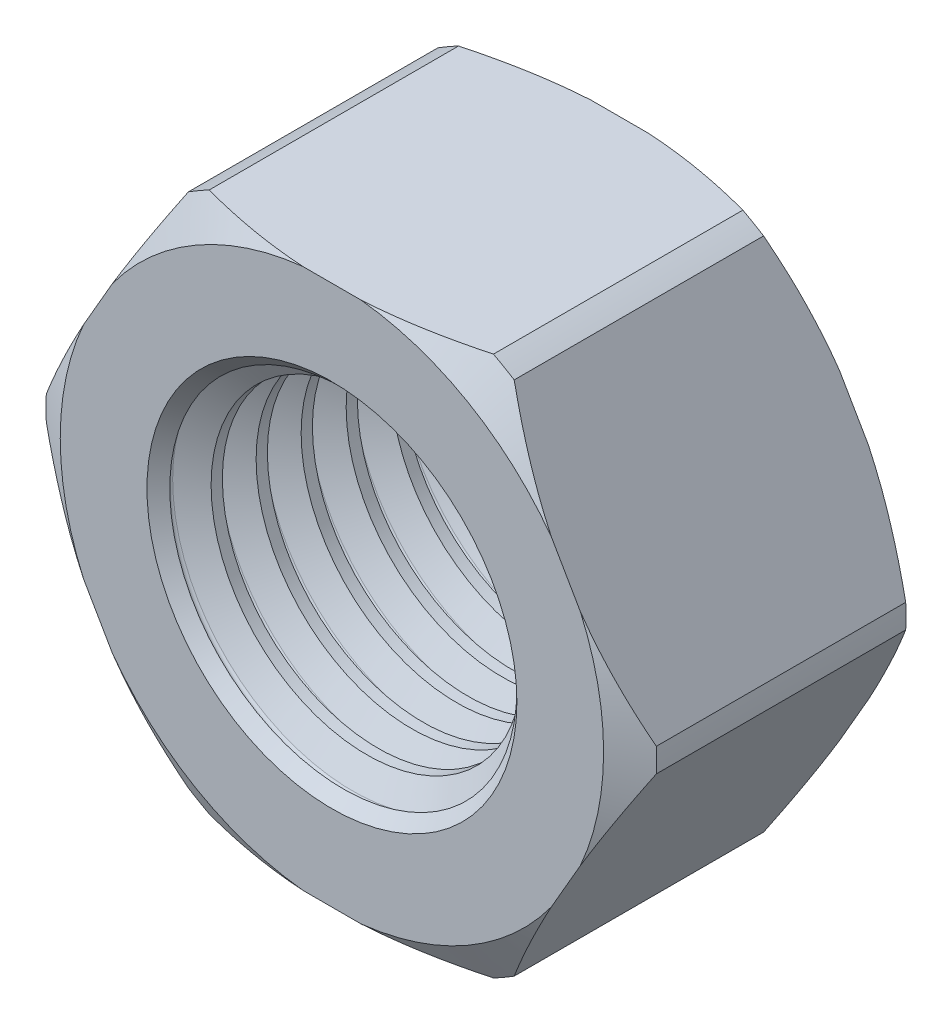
ISO-10303-21;
HEADER;
FILE_DESCRIPTION(('STEP AP214'),'2;1');
FILE_NAME('part.step','',(''),(''),'','','');
FILE_SCHEMA(('AUTOMOTIVE_DESIGN { 1 0 10303 214 1 1 1 1 }'));
ENDSEC;
DATA;
#1=APPLICATION_CONTEXT('core data for automotive mechanical design processes');
#2=APPLICATION_PROTOCOL_DEFINITION('international standard','automotive_design',2000,#1);
#3=PRODUCT_CONTEXT('',#1,'mechanical');
#4=PRODUCT('Part','Part','',(#3));
#5=PRODUCT_RELATED_PRODUCT_CATEGORY('part','',(#4));
#6=PRODUCT_DEFINITION_FORMATION('','',#4);
#7=PRODUCT_DEFINITION_CONTEXT('part definition',#1,'design');
#8=PRODUCT_DEFINITION('design','',#6,#7);
#9=PRODUCT_DEFINITION_SHAPE('','',#8);
#10=(LENGTH_UNIT() NAMED_UNIT(*) SI_UNIT(.MILLI.,.METRE.));
#11=(NAMED_UNIT(*) PLANE_ANGLE_UNIT() SI_UNIT($,.RADIAN.));
#12=(NAMED_UNIT(*) SI_UNIT($,.STERADIAN.) SOLID_ANGLE_UNIT());
#13=UNCERTAINTY_MEASURE_WITH_UNIT(LENGTH_MEASURE(1.E-05),#10,'distance_accuracy_value','');
#14=(GEOMETRIC_REPRESENTATION_CONTEXT(3) GLOBAL_UNCERTAINTY_ASSIGNED_CONTEXT((#13)) GLOBAL_UNIT_ASSIGNED_CONTEXT((#10,
#11,#12)) REPRESENTATION_CONTEXT('',''));
#15=CARTESIAN_POINT('',(0.,0.,0.));
#16=DIRECTION('',(0.,0.,1.));
#17=DIRECTION('',(1.,0.,0.));
#18=AXIS2_PLACEMENT_3D('',#15,#16,#17);
#19=CARTESIAN_POINT('',(0.,0.,-8.34375));
#20=DIRECTION('',(0.,0.,-1.));
#21=DIRECTION('',(-1.,0.,0.));
#22=AXIS2_PLACEMENT_3D('',#19,#20,#21);
#23=CONICAL_SURFACE('',#22,10.,1.0471975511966);
#24=CARTESIAN_POINT('',(0.,0.,-7.5625));
#25=DIRECTION('',(0.,0.,1.));
#26=DIRECTION('',(1.,0.,0.));
#27=AXIS2_PLACEMENT_3D('',#24,#25,#26);
#28=CIRCLE('',#27,8.64683530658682);
#29=CARTESIAN_POINT('',(8.64683530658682,0.,-7.5625));
#30=VERTEX_POINT('',#29);
#31=EDGE_CURVE('E479',#30,#30,#28,.T.);
#32=ORIENTED_EDGE('',*,*,#31,.T.);
#33=EDGE_LOOP('',(#32));
#34=FACE_BOUND('',#33,.T.);
#35=CARTESIAN_POINT('',(0.,0.,-8.34375));
#36=DIRECTION('',(0.,0.,1.));
#37=DIRECTION('',(1.,0.,0.));
#38=AXIS2_PLACEMENT_3D('',#35,#36,#37);
#39=CIRCLE('',#38,10.);
#40=CARTESIAN_POINT('',(10.,0.,-8.34375));
#41=VERTEX_POINT('',#40);
#42=EDGE_CURVE('E476',#41,#41,#39,.F.);
#43=ORIENTED_EDGE('',*,*,#42,.T.);
#44=EDGE_LOOP('',(#43));
#45=FACE_BOUND('',#44,.T.);
#46=ADVANCED_FACE('F15',(#34,#45),#23,.F.);
#47=CARTESIAN_POINT('',(0.,0.,0.));
#48=DIRECTION('',(0.,0.,1.));
#49=DIRECTION('',(1.,0.,0.));
#50=AXIS2_PLACEMENT_3D('',#47,#48,#49);
#51=CYLINDRICAL_SURFACE('',#50,8.64683530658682);
#52=CARTESIAN_POINT('',(0.,0.,-6.9375));
#53=DIRECTION('',(0.,0.,1.));
#54=DIRECTION('',(1.,0.,0.));
#55=AXIS2_PLACEMENT_3D('',#52,#53,#54);
#56=CIRCLE('',#55,8.64683530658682);
#57=CARTESIAN_POINT('',(8.64683530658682,0.,-6.9375));
#58=VERTEX_POINT('',#57);
#59=EDGE_CURVE('E475',#58,#58,#56,.T.);
#60=ORIENTED_EDGE('',*,*,#59,.T.);
#61=EDGE_LOOP('',(#60));
#62=FACE_BOUND('',#61,.T.);
#63=ORIENTED_EDGE('',*,*,#31,.F.);
#64=EDGE_LOOP('',(#63));
#65=FACE_BOUND('',#64,.T.);
#66=ADVANCED_FACE('F470',(#62,#65),#51,.F.);
#67=CARTESIAN_POINT('',(0.,0.,-8.5));
#68=DIRECTION('',(0.,0.,1.));
#69=DIRECTION('',(1.,0.,0.));
#70=AXIS2_PLACEMENT_3D('',#67,#68,#69);
#71=TOROIDAL_SURFACE('',#70,9.90978902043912,0.180421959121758);
#72=CARTESIAN_POINT('',(0.,0.,-8.65625));
#73=DIRECTION('',(0.,0.,1.));
#74=DIRECTION('',(1.,0.,0.));
#75=AXIS2_PLACEMENT_3D('',#72,#73,#74);
#76=CIRCLE('',#75,10.);
#77=CARTESIAN_POINT('',(10.,0.,-8.65625));
#78=VERTEX_POINT('',#77);
#79=EDGE_CURVE('E1087',#78,#78,#76,.F.);
#80=ORIENTED_EDGE('',*,*,#79,.T.);
#81=EDGE_LOOP('',(#80));
#82=FACE_BOUND('',#81,.T.);
#83=ORIENTED_EDGE('',*,*,#42,.F.);
#84=EDGE_LOOP('',(#83));
#85=FACE_BOUND('',#84,.T.);
#86=ADVANCED_FACE('F466',(#82,#85),#71,.F.);
#87=CARTESIAN_POINT('',(0.,0.,-6.15625));
#88=DIRECTION('',(0.,0.,1.));
#89=DIRECTION('',(1.,0.,0.));
#90=AXIS2_PLACEMENT_3D('',#87,#88,#89);
#91=CONICAL_SURFACE('',#90,10.,1.0471975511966);
#92=CARTESIAN_POINT('',(0.,0.,-6.15625));
#93=DIRECTION('',(0.,0.,1.));
#94=DIRECTION('',(1.,0.,0.));
#95=AXIS2_PLACEMENT_3D('',#92,#93,#94);
#96=CIRCLE('',#95,10.);
#97=CARTESIAN_POINT('',(10.,0.,-6.15625));
#98=VERTEX_POINT('',#97);
#99=EDGE_CURVE('E447',#98,#98,#96,.T.);
#100=ORIENTED_EDGE('',*,*,#99,.T.);
#101=EDGE_LOOP('',(#100));
#102=FACE_BOUND('',#101,.T.);
#103=ORIENTED_EDGE('',*,*,#59,.F.);
#104=EDGE_LOOP('',(#103));
#105=FACE_BOUND('',#104,.T.);
#106=ADVANCED_FACE('F462',(#102,#105),#91,.F.);
#107=CARTESIAN_POINT('',(0.,0.,-8.65625));
#108=DIRECTION('',(0.,0.,1.));
#109=DIRECTION('',(1.,0.,0.));
#110=AXIS2_PLACEMENT_3D('',#107,#108,#109);
#111=CONICAL_SURFACE('',#110,10.,1.0471975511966);
#112=CARTESIAN_POINT('',(0.,0.,-9.4375));
#113=DIRECTION('',(0.,0.,1.));
#114=DIRECTION('',(1.,0.,0.));
#115=AXIS2_PLACEMENT_3D('',#112,#113,#114);
#116=CIRCLE('',#115,8.64683530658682);
#117=CARTESIAN_POINT('',(8.64683530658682,0.,-9.4375));
#118=VERTEX_POINT('',#117);
#119=EDGE_CURVE('E444',#118,#118,#116,.F.);
#120=ORIENTED_EDGE('',*,*,#119,.T.);
#121=EDGE_LOOP('',(#120));
#122=FACE_BOUND('',#121,.T.);
#123=ORIENTED_EDGE('',*,*,#79,.F.);
#124=EDGE_LOOP('',(#123));
#125=FACE_BOUND('',#124,.T.);
#126=ADVANCED_FACE('F457',(#122,#125),#111,.F.);
#127=CARTESIAN_POINT('',(0.,0.,-6.));
#128=DIRECTION('',(0.,0.,1.));
#129=DIRECTION('',(1.,0.,0.));
#130=AXIS2_PLACEMENT_3D('',#127,#128,#129);
#131=TOROIDAL_SURFACE('',#130,9.90978902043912,0.180421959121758);
#132=ORIENTED_EDGE('',*,*,#99,.F.);
#133=EDGE_LOOP('',(#132));
#134=FACE_BOUND('',#133,.T.);
#135=CARTESIAN_POINT('',(0.,0.,-5.84375));
#136=DIRECTION('',(0.,0.,-1.));
#137=DIRECTION('',(-1.,0.,0.));
#138=AXIS2_PLACEMENT_3D('',#135,#136,#137);
#139=CIRCLE('',#138,10.);
#140=CARTESIAN_POINT('',(-10.,0.,-5.84375));
#141=VERTEX_POINT('',#140);
#142=EDGE_CURVE('E441',#141,#141,#139,.F.);
#143=ORIENTED_EDGE('',*,*,#142,.T.);
#144=EDGE_LOOP('',(#143));
#145=FACE_BOUND('',#144,.T.);
#146=ADVANCED_FACE('F452',(#134,#145),#131,.F.);
#147=CARTESIAN_POINT('',(0.,0.,0.));
#148=DIRECTION('',(0.,0.,1.));
#149=DIRECTION('',(1.,0.,0.));
#150=AXIS2_PLACEMENT_3D('',#147,#148,#149);
#151=CYLINDRICAL_SURFACE('',#150,8.64683530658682);
#152=CARTESIAN_POINT('',(0.,0.,-10.0625));
#153=DIRECTION('',(0.,0.,-1.));
#154=DIRECTION('',(-1.,0.,0.));
#155=AXIS2_PLACEMENT_3D('',#152,#153,#154);
#156=CIRCLE('',#155,8.64683530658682);
#157=CARTESIAN_POINT('',(-8.64683530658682,0.,-10.0625));
#158=VERTEX_POINT('',#157);
#159=EDGE_CURVE('E438',#158,#158,#156,.T.);
#160=ORIENTED_EDGE('',*,*,#159,.T.);
#161=EDGE_LOOP('',(#160));
#162=FACE_BOUND('',#161,.T.);
#163=ORIENTED_EDGE('',*,*,#119,.F.);
#164=EDGE_LOOP('',(#163));
#165=FACE_BOUND('',#164,.T.);
#166=ADVANCED_FACE('F456',(#162,#165),#151,.F.);
#167=CARTESIAN_POINT('',(0.,0.,-5.84375));
#168=DIRECTION('',(0.,0.,-1.));
#169=DIRECTION('',(-1.,0.,0.));
#170=AXIS2_PLACEMENT_3D('',#167,#168,#169);
#171=CONICAL_SURFACE('',#170,10.,1.0471975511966);
#172=ORIENTED_EDGE('',*,*,#142,.F.);
#173=EDGE_LOOP('',(#172));
#174=FACE_BOUND('',#173,.T.);
#175=CARTESIAN_POINT('',(0.,0.,-5.0625));
#176=DIRECTION('',(0.,0.,1.));
#177=DIRECTION('',(1.,0.,0.));
#178=AXIS2_PLACEMENT_3D('',#175,#176,#177);
#179=CIRCLE('',#178,8.64683530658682);
#180=CARTESIAN_POINT('',(8.64683530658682,0.,-5.0625));
#181=VERTEX_POINT('',#180);
#182=EDGE_CURVE('E435',#181,#181,#179,.T.);
#183=ORIENTED_EDGE('',*,*,#182,.T.);
#184=EDGE_LOOP('',(#183));
#185=FACE_BOUND('',#184,.T.);
#186=ADVANCED_FACE('F1006',(#174,#185),#171,.F.);
#187=CARTESIAN_POINT('',(0.,0.,-10.84375));
#188=DIRECTION('',(0.,0.,-1.));
#189=DIRECTION('',(-1.,0.,0.));
#190=AXIS2_PLACEMENT_3D('',#187,#188,#189);
#191=CONICAL_SURFACE('',#190,10.,1.0471975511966);
#192=ORIENTED_EDGE('',*,*,#159,.F.);
#193=EDGE_LOOP('',(#192));
#194=FACE_BOUND('',#193,.T.);
#195=CARTESIAN_POINT('',(0.,0.,-10.84375));
#196=DIRECTION('',(0.,0.,1.));
#197=DIRECTION('',(1.,0.,0.));
#198=AXIS2_PLACEMENT_3D('',#195,#196,#197);
#199=CIRCLE('',#198,10.);
#200=CARTESIAN_POINT('',(10.,0.,-10.84375));
#201=VERTEX_POINT('',#200);
#202=EDGE_CURVE('E432',#201,#201,#199,.F.);
#203=ORIENTED_EDGE('',*,*,#202,.T.);
#204=EDGE_LOOP('',(#203));
#205=FACE_BOUND('',#204,.T.);
#206=ADVANCED_FACE('F998',(#194,#205),#191,.F.);
#207=CARTESIAN_POINT('',(0.,0.,0.));
#208=DIRECTION('',(0.,0.,1.));
#209=DIRECTION('',(1.,0.,0.));
#210=AXIS2_PLACEMENT_3D('',#207,#208,#209);
#211=CYLINDRICAL_SURFACE('',#210,8.64683530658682);
#212=CARTESIAN_POINT('',(0.,0.,-4.4375));
#213=DIRECTION('',(0.,0.,1.));
#214=DIRECTION('',(1.,0.,0.));
#215=AXIS2_PLACEMENT_3D('',#212,#213,#214);
#216=CIRCLE('',#215,8.64683530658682);
#217=CARTESIAN_POINT('',(8.64683530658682,0.,-4.4375));
#218=VERTEX_POINT('',#217);
#219=EDGE_CURVE('E431',#218,#218,#216,.T.);
#220=ORIENTED_EDGE('',*,*,#219,.T.);
#221=EDGE_LOOP('',(#220));
#222=FACE_BOUND('',#221,.T.);
#223=ORIENTED_EDGE('',*,*,#182,.F.);
#224=EDGE_LOOP('',(#223));
#225=FACE_BOUND('',#224,.T.);
#226=ADVANCED_FACE('F425',(#222,#225),#211,.F.);
#227=CARTESIAN_POINT('',(0.,0.,-11.));
#228=DIRECTION('',(0.,0.,1.));
#229=DIRECTION('',(1.,0.,0.));
#230=AXIS2_PLACEMENT_3D('',#227,#228,#229);
#231=TOROIDAL_SURFACE('',#230,9.90978902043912,0.180421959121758);
#232=CARTESIAN_POINT('',(0.,0.,-11.15625));
#233=DIRECTION('',(0.,0.,1.));
#234=DIRECTION('',(1.,0.,0.));
#235=AXIS2_PLACEMENT_3D('',#232,#233,#234);
#236=CIRCLE('',#235,10.);
#237=CARTESIAN_POINT('',(10.,0.,-11.15625));
#238=VERTEX_POINT('',#237);
#239=EDGE_CURVE('E1107',#238,#238,#236,.F.);
#240=ORIENTED_EDGE('',*,*,#239,.T.);
#241=EDGE_LOOP('',(#240));
#242=FACE_BOUND('',#241,.T.);
#243=ORIENTED_EDGE('',*,*,#202,.F.);
#244=EDGE_LOOP('',(#243));
#245=FACE_BOUND('',#244,.T.);
#246=ADVANCED_FACE('F420',(#242,#245),#231,.F.);
#247=CARTESIAN_POINT('',(0.,0.,-3.65625));
#248=DIRECTION('',(0.,0.,1.));
#249=DIRECTION('',(0.,-1.,0.));
#250=AXIS2_PLACEMENT_3D('',#247,#248,#249);
#251=CONICAL_SURFACE('',#250,10.,1.0471975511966);
#252=CARTESIAN_POINT('',(0.,0.,-3.65625));
#253=DIRECTION('',(0.,0.,1.));
#254=DIRECTION('',(1.,0.,0.));
#255=AXIS2_PLACEMENT_3D('',#252,#253,#254);
#256=CIRCLE('',#255,10.);
#257=CARTESIAN_POINT('',(10.,0.,-3.65625));
#258=VERTEX_POINT('',#257);
#259=EDGE_CURVE('E401',#258,#258,#256,.T.);
#260=ORIENTED_EDGE('',*,*,#259,.T.);
#261=EDGE_LOOP('',(#260));
#262=FACE_BOUND('',#261,.T.);
#263=ORIENTED_EDGE('',*,*,#219,.F.);
#264=EDGE_LOOP('',(#263));
#265=FACE_BOUND('',#264,.T.);
#266=ADVANCED_FACE('F416',(#262,#265),#251,.F.);
#267=CARTESIAN_POINT('',(0.,0.,-11.15625));
#268=DIRECTION('',(0.,0.,1.));
#269=DIRECTION('',(1.,0.,0.));
#270=AXIS2_PLACEMENT_3D('',#267,#268,#269);
#271=CONICAL_SURFACE('',#270,10.,1.0471975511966);
#272=ORIENTED_EDGE('',*,*,#239,.F.);
#273=EDGE_LOOP('',(#272));
#274=FACE_BOUND('',#273,.T.);
#275=CARTESIAN_POINT('',(0.,0.,-11.9375));
#276=DIRECTION('',(0.,0.,1.));
#277=DIRECTION('',(1.,0.,0.));
#278=AXIS2_PLACEMENT_3D('',#275,#276,#277);
#279=CIRCLE('',#278,8.64683530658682);
#280=CARTESIAN_POINT('',(8.64683530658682,0.,-11.9375));
#281=VERTEX_POINT('',#280);
#282=EDGE_CURVE('E398',#281,#281,#279,.F.);
#283=ORIENTED_EDGE('',*,*,#282,.T.);
#284=EDGE_LOOP('',(#283));
#285=FACE_BOUND('',#284,.T.);
#286=ADVANCED_FACE('F411',(#274,#285),#271,.F.);
#287=CARTESIAN_POINT('',(0.,0.,-3.5));
#288=DIRECTION('',(0.,0.,1.));
#289=DIRECTION('',(1.,0.,0.));
#290=AXIS2_PLACEMENT_3D('',#287,#288,#289);
#291=TOROIDAL_SURFACE('',#290,9.90978902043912,0.180421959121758);
#292=ORIENTED_EDGE('',*,*,#259,.F.);
#293=EDGE_LOOP('',(#292));
#294=FACE_BOUND('',#293,.T.);
#295=CARTESIAN_POINT('',(0.,0.,-3.34375));
#296=DIRECTION('',(0.,0.,-1.));
#297=DIRECTION('',(-1.,0.,0.));
#298=AXIS2_PLACEMENT_3D('',#295,#296,#297);
#299=CIRCLE('',#298,10.);
#300=CARTESIAN_POINT('',(-10.,0.,-3.34375));
#301=VERTEX_POINT('',#300);
#302=EDGE_CURVE('E395',#301,#301,#299,.F.);
#303=ORIENTED_EDGE('',*,*,#302,.T.);
#304=EDGE_LOOP('',(#303));
#305=FACE_BOUND('',#304,.T.);
#306=ADVANCED_FACE('F406',(#294,#305),#291,.F.);
#307=CARTESIAN_POINT('',(0.,0.,0.));
#308=DIRECTION('',(0.,0.,1.));
#309=DIRECTION('',(1.,0.,0.));
#310=AXIS2_PLACEMENT_3D('',#307,#308,#309);
#311=CYLINDRICAL_SURFACE('',#310,8.64683530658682);
#312=ORIENTED_EDGE('',*,*,#282,.F.);
#313=EDGE_LOOP('',(#312));
#314=FACE_BOUND('',#313,.T.);
#315=CARTESIAN_POINT('',(0.,0.,-12.5625));
#316=DIRECTION('',(0.,0.,-1.));
#317=DIRECTION('',(-1.,0.,0.));
#318=AXIS2_PLACEMENT_3D('',#315,#316,#317);
#319=CIRCLE('',#318,8.64683530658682);
#320=CARTESIAN_POINT('',(-8.64683530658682,0.,-12.5625));
#321=VERTEX_POINT('',#320);
#322=EDGE_CURVE('E392',#321,#321,#319,.T.);
#323=ORIENTED_EDGE('',*,*,#322,.T.);
#324=EDGE_LOOP('',(#323));
#325=FACE_BOUND('',#324,.T.);
#326=ADVANCED_FACE('F410',(#314,#325),#311,.F.);
#327=CARTESIAN_POINT('',(0.,0.,-3.34375));
#328=DIRECTION('',(0.,0.,-1.));
#329=DIRECTION('',(-1.,0.,0.));
#330=AXIS2_PLACEMENT_3D('',#327,#328,#329);
#331=CONICAL_SURFACE('',#330,10.,1.0471975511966);
#332=ORIENTED_EDGE('',*,*,#302,.F.);
#333=EDGE_LOOP('',(#332));
#334=FACE_BOUND('',#333,.T.);
#335=CARTESIAN_POINT('',(0.,0.,-2.5625));
#336=DIRECTION('',(0.,0.,1.));
#337=DIRECTION('',(1.,0.,0.));
#338=AXIS2_PLACEMENT_3D('',#335,#336,#337);
#339=CIRCLE('',#338,8.64683530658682);
#340=CARTESIAN_POINT('',(8.64683530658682,0.,-2.5625));
#341=VERTEX_POINT('',#340);
#342=EDGE_CURVE('E389',#341,#341,#339,.T.);
#343=ORIENTED_EDGE('',*,*,#342,.T.);
#344=EDGE_LOOP('',(#343));
#345=FACE_BOUND('',#344,.T.);
#346=ADVANCED_FACE('F956',(#334,#345),#331,.F.);
#347=CARTESIAN_POINT('',(0.,0.,-13.34375));
#348=DIRECTION('',(0.,0.,-1.));
#349=DIRECTION('',(0.,1.,0.));
#350=AXIS2_PLACEMENT_3D('',#347,#348,#349);
#351=CONICAL_SURFACE('',#350,10.,1.0471975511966);
#352=CARTESIAN_POINT('',(0.,0.,-13.34375));
#353=DIRECTION('',(0.,0.,1.));
#354=DIRECTION('',(1.,0.,0.));
#355=AXIS2_PLACEMENT_3D('',#352,#353,#354);
#356=CIRCLE('',#355,10.);
#357=CARTESIAN_POINT('',(10.,0.,-13.34375));
#358=VERTEX_POINT('',#357);
#359=EDGE_CURVE('E385',#358,#358,#356,.F.);
#360=ORIENTED_EDGE('',*,*,#359,.T.);
#361=EDGE_LOOP('',(#360));
#362=FACE_BOUND('',#361,.T.);
#363=ORIENTED_EDGE('',*,*,#322,.F.);
#364=EDGE_LOOP('',(#363));
#365=FACE_BOUND('',#364,.T.);
#366=ADVANCED_FACE('F948',(#362,#365),#351,.F.);
#367=CARTESIAN_POINT('',(0.,0.,0.));
#368=DIRECTION('',(0.,0.,1.));
#369=DIRECTION('',(1.,0.,0.));
#370=AXIS2_PLACEMENT_3D('',#367,#368,#369);
#371=CYLINDRICAL_SURFACE('',#370,8.64683530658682);
#372=CARTESIAN_POINT('',(0.,0.,-1.9375));
#373=DIRECTION('',(0.,0.,1.));
#374=DIRECTION('',(1.,0.,0.));
#375=AXIS2_PLACEMENT_3D('',#372,#373,#374);
#376=CIRCLE('',#375,8.64683530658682);
#377=CARTESIAN_POINT('',(8.64683530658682,0.,-1.9375));
#378=VERTEX_POINT('',#377);
#379=EDGE_CURVE('E388',#378,#378,#376,.T.);
#380=ORIENTED_EDGE('',*,*,#379,.T.);
#381=EDGE_LOOP('',(#380));
#382=FACE_BOUND('',#381,.T.);
#383=ORIENTED_EDGE('',*,*,#342,.F.);
#384=EDGE_LOOP('',(#383));
#385=FACE_BOUND('',#384,.T.);
#386=ADVANCED_FACE('F377',(#382,#385),#371,.F.);
#387=CARTESIAN_POINT('',(0.,0.,-13.5));
#388=DIRECTION('',(0.,0.,1.));
#389=DIRECTION('',(1.,0.,0.));
#390=AXIS2_PLACEMENT_3D('',#387,#388,#389);
#391=TOROIDAL_SURFACE('',#390,9.90978902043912,0.180421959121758);
#392=CARTESIAN_POINT('',(0.,0.,-13.65625));
#393=DIRECTION('',(0.,0.,1.));
#394=DIRECTION('',(1.,0.,0.));
#395=AXIS2_PLACEMENT_3D('',#392,#393,#394);
#396=CIRCLE('',#395,10.);
#397=CARTESIAN_POINT('',(10.,0.,-13.65625));
#398=VERTEX_POINT('',#397);
#399=EDGE_CURVE('E383',#398,#398,#396,.F.);
#400=ORIENTED_EDGE('',*,*,#399,.T.);
#401=EDGE_LOOP('',(#400));
#402=FACE_BOUND('',#401,.T.);
#403=ORIENTED_EDGE('',*,*,#359,.F.);
#404=EDGE_LOOP('',(#403));
#405=FACE_BOUND('',#404,.T.);
#406=ADVANCED_FACE('F372',(#402,#405),#391,.F.);
#407=CARTESIAN_POINT('',(0.,0.,-1.15625));
#408=DIRECTION('',(0.,0.,1.));
#409=DIRECTION('',(1.,0.,0.));
#410=AXIS2_PLACEMENT_3D('',#407,#408,#409);
#411=CONICAL_SURFACE('',#410,10.,1.0471975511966);
#412=CARTESIAN_POINT('',(0.,0.,-1.15625));
#413=DIRECTION('',(0.,0.,1.));
#414=DIRECTION('',(1.,0.,0.));
#415=AXIS2_PLACEMENT_3D('',#412,#413,#414);
#416=CIRCLE('',#415,10.);
#417=CARTESIAN_POINT('',(10.,0.,-1.15625));
#418=VERTEX_POINT('',#417);
#419=EDGE_CURVE('E355',#418,#418,#416,.T.);
#420=ORIENTED_EDGE('',*,*,#419,.T.);
#421=EDGE_LOOP('',(#420));
#422=FACE_BOUND('',#421,.T.);
#423=ORIENTED_EDGE('',*,*,#379,.F.);
#424=EDGE_LOOP('',(#423));
#425=FACE_BOUND('',#424,.T.);
#426=ADVANCED_FACE('F368',(#422,#425),#411,.F.);
#427=CARTESIAN_POINT('',(0.,0.,-13.65625));
#428=DIRECTION('',(0.,0.,1.));
#429=DIRECTION('',(1.,0.,0.));
#430=AXIS2_PLACEMENT_3D('',#427,#428,#429);
#431=CONICAL_SURFACE('',#430,10.,1.0471975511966);
#432=ORIENTED_EDGE('',*,*,#399,.F.);
#433=EDGE_LOOP('',(#432));
#434=FACE_BOUND('',#433,.T.);
#435=CARTESIAN_POINT('',(0.,0.,-14.4150635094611));
#436=DIRECTION('',(0.,0.,-1.));
#437=DIRECTION('',(-1.,0.,0.));
#438=AXIS2_PLACEMENT_3D('',#435,#436,#437);
#439=CIRCLE('',#438,8.68569644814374);
#440=CARTESIAN_POINT('',(-8.68569644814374,0.,-14.4150635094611));
#441=VERTEX_POINT('',#440);
#442=EDGE_CURVE('E352',#441,#441,#439,.T.);
#443=ORIENTED_EDGE('',*,*,#442,.T.);
#444=EDGE_LOOP('',(#443));
#445=FACE_BOUND('',#444,.T.);
#446=ADVANCED_FACE('F363',(#434,#445),#431,.F.);
#447=CARTESIAN_POINT('',(0.,0.,-1.));
#448=DIRECTION('',(0.,0.,1.));
#449=DIRECTION('',(1.,0.,0.));
#450=AXIS2_PLACEMENT_3D('',#447,#448,#449);
#451=TOROIDAL_SURFACE('',#450,9.90978902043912,0.180421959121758);
#452=ORIENTED_EDGE('',*,*,#419,.F.);
#453=EDGE_LOOP('',(#452));
#454=FACE_BOUND('',#453,.T.);
#455=CARTESIAN_POINT('',(0.,0.,-0.843750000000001));
#456=DIRECTION('',(0.,0.,-1.));
#457=DIRECTION('',(-1.,0.,0.));
#458=AXIS2_PLACEMENT_3D('',#455,#456,#457);
#459=CIRCLE('',#458,10.);
#460=CARTESIAN_POINT('',(-10.,0.,-0.843750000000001));
#461=VERTEX_POINT('',#460);
#462=EDGE_CURVE('E347',#461,#461,#459,.F.);
#463=ORIENTED_EDGE('',*,*,#462,.T.);
#464=EDGE_LOOP('',(#463));
#465=FACE_BOUND('',#464,.T.);
#466=ADVANCED_FACE('F358',(#454,#465),#451,.F.);
#467=CARTESIAN_POINT('',(0.,0.,-16.));
#468=DIRECTION('',(0.,0.,-1.));
#469=DIRECTION('',(-1.,0.,0.));
#470=AXIS2_PLACEMENT_3D('',#467,#468,#469);
#471=CONICAL_SURFACE('',#470,10.2706329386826,0.785398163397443);
#472=CARTESIAN_POINT('',(0.,0.,-16.));
#473=DIRECTION('',(0.,0.,-1.));
#474=DIRECTION('',(-1.,0.,0.));
#475=AXIS2_PLACEMENT_3D('',#472,#473,#474);
#476=CIRCLE('',#475,10.2706329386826);
#477=CARTESIAN_POINT('',(-10.2706329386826,0.,-16.));
#478=VERTEX_POINT('',#477);
#479=EDGE_CURVE('E18',#478,#478,#476,.T.);
#480=ORIENTED_EDGE('',*,*,#479,.T.);
#481=EDGE_LOOP('',(#480));
#482=FACE_BOUND('',#481,.T.);
#483=ORIENTED_EDGE('',*,*,#442,.F.);
#484=EDGE_LOOP('',(#483));
#485=FACE_BOUND('',#484,.T.);
#486=ADVANCED_FACE('F362',(#482,#485),#471,.F.);
#487=CARTESIAN_POINT('',(0.,0.,-0.843750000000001));
#488=DIRECTION('',(0.,0.,-1.));
#489=DIRECTION('',(0.,1.,0.));
#490=AXIS2_PLACEMENT_3D('',#487,#488,#489);
#491=CONICAL_SURFACE('',#490,10.,1.0471975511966);
#492=ORIENTED_EDGE('',*,*,#462,.F.);
#493=EDGE_LOOP('',(#492));
#494=FACE_BOUND('',#493,.T.);
#495=CARTESIAN_POINT('',(0.,0.,-0.633974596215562));
#496=DIRECTION('',(0.,0.,1.));
#497=DIRECTION('',(1.,0.,0.));
#498=AXIS2_PLACEMENT_3D('',#495,#496,#497);
#499=CIRCLE('',#498,9.63665834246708);
#500=CARTESIAN_POINT('',(9.63665834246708,0.,-0.633974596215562));
#501=VERTEX_POINT('',#500);
#502=EDGE_CURVE('E326',#501,#501,#499,.T.);
#503=ORIENTED_EDGE('',*,*,#502,.T.);
#504=EDGE_LOOP('',(#503));
#505=FACE_BOUND('',#504,.T.);
#506=ADVANCED_FACE('F606',(#494,#505),#491,.F.);
#507=CARTESIAN_POINT('',(0.,0.,-14.9235304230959));
#508=DIRECTION('',(0.,0.,1.));
#509=DIRECTION('',(0.,-1.,0.));
#510=AXIS2_PLACEMENT_3D('',#507,#508,#509);
#511=CONICAL_SURFACE('',#510,16.95,1.0471975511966);
#512=CARTESIAN_POINT('',(-12.1884598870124,-8.8889682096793,-16.));
#513=CARTESIAN_POINT('',(-12.055335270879,-9.11954680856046,-15.9836707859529));
#514=CARTESIAN_POINT('',(-11.9223389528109,-9.34990318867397,-15.9633065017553));
#515=CARTESIAN_POINT('',(-11.6567124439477,-9.80998179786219,-15.9148067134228));
#516=CARTESIAN_POINT('',(-11.5240822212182,-10.039704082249,-15.886671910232));
#517=CARTESIAN_POINT('',(-11.2596093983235,-10.4977844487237,-15.8230078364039));
#518=CARTESIAN_POINT('',(-11.1277656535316,-10.7261445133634,-15.7874975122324));
#519=CARTESIAN_POINT('',(-10.8646027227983,-11.1819560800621,-15.7094130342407));
#520=CARTESIAN_POINT('',(-10.7332835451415,-11.409407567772,-15.6668387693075));
#521=CARTESIAN_POINT('',(-10.3403409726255,-12.0900040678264,-15.5291700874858));
#522=CARTESIAN_POINT('',(-10.0795878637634,-12.5416417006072,-15.4240941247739));
#523=CARTESIAN_POINT('',(-9.56000244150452,-13.4415900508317,-15.1905152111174));
#524=CARTESIAN_POINT('',(-9.30117677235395,-13.8898892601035,-15.0619528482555));
#525=CARTESIAN_POINT('',(-9.04378442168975,-14.3357058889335,-14.9235304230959));
#526=B_SPLINE_CURVE_WITH_KNOTS('',3,(#512,#513,#514,#515,#516,#517,#518,#519,#520,#521,#522,
#523,#524,#525),.UNSPECIFIED.,.F.,.F.,(4,2,2,2,2,2,4),(0.,0.800204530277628,1.60033690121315,
2.39843874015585,3.19655313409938,4.79190843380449,6.39135672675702),.UNSPECIFIED.);
#527=CARTESIAN_POINT('',(-12.1884598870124,-8.88896820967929,-16.));
#528=VERTEX_POINT('',#527);
#529=CARTESIAN_POINT('',(-9.04378442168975,-14.3357058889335,-14.9235304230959));
#530=VERTEX_POINT('',#529);
#531=EDGE_CURVE('E300',#528,#530,#526,.T.);
#532=ORIENTED_EDGE('',*,*,#531,.F.);
#533=CARTESIAN_POINT('',(0.,0.,-16.));
#534=DIRECTION('',(0.,0.,1.));
#535=DIRECTION('',(0.,-1.,0.));
#536=AXIS2_PLACEMENT_3D('',#533,#534,#535);
#537=CIRCLE('',#536,15.0855);
#538=CARTESIAN_POINT('',(-1.60384233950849,-15.,-16.));
#539=VERTEX_POINT('',#538);
#540=EDGE_CURVE('E690',#528,#539,#537,.T.);
#541=ORIENTED_EDGE('',*,*,#540,.T.);
#542=CARTESIAN_POINT('',(-7.89319327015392,-15.,-14.9235304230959));
#543=CARTESIAN_POINT('',(-7.37840856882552,-15.,-15.0619528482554));
#544=CARTESIAN_POINT('',(-6.86075723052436,-15.,-15.1905152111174));
#545=CARTESIAN_POINT('',(-5.82158638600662,-15.,-15.4240941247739));
#546=CARTESIAN_POINT('',(-5.30008016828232,-15.,-15.5291700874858));
#547=CARTESIAN_POINT('',(-4.51419502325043,-15.,-15.6668387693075));
#548=CARTESIAN_POINT('',(-4.25155666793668,-15.,-15.7094130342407));
#549=CARTESIAN_POINT('',(-3.72523080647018,-15.,-15.7874975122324));
#550=CARTESIAN_POINT('',(-3.46154331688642,-15.,-15.8230078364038));
#551=CARTESIAN_POINT('',(-2.93259767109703,-15.,-15.886671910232));
#552=CARTESIAN_POINT('',(-2.66733722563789,-15.,-15.9148067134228));
#553=CARTESIAN_POINT('',(-2.13608420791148,-15.,-15.9633065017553));
#554=CARTESIAN_POINT('',(-1.8700915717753,-15.,-15.9836707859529));
#555=CARTESIAN_POINT('',(-1.60384233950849,-15.,-16.));
#556=B_SPLINE_CURVE_WITH_KNOTS('',3,(#542,#543,#544,#545,#546,#547,#548,#549,#550,#551,#552,
#553,#554,#555),.UNSPECIFIED.,.F.,.F.,(4,2,2,2,2,2,4),(0.,1.59944829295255,3.19480359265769,
3.99291798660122,4.79101982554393,5.59115219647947,6.39135672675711),.UNSPECIFIED.);
#557=CARTESIAN_POINT('',(-7.89319327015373,-15.,-14.9235304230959));
#558=VERTEX_POINT('',#557);
#559=EDGE_CURVE('E316',#558,#539,#556,.T.);
#560=ORIENTED_EDGE('',*,*,#559,.F.);
#561=CARTESIAN_POINT('',(0.,0.,-14.9235304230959));
#562=DIRECTION('',(0.,0.,1.));
#563=DIRECTION('',(1.,0.,0.));
#564=AXIS2_PLACEMENT_3D('',#561,#562,#563);
#565=CIRCLE('',#564,16.95);
#566=EDGE_CURVE('E342',#530,#558,#565,.T.);
#567=ORIENTED_EDGE('',*,*,#566,.F.);
#568=EDGE_LOOP('',(#532,#541,#560,#567));
#569=FACE_BOUND('',#568,.T.);
#570=ADVANCED_FACE('F608',(#569),#511,.T.);
#571=CARTESIAN_POINT('',(0.,0.,0.));
#572=DIRECTION('',(0.,0.,1.));
#573=DIRECTION('',(1.,0.,0.));
#574=AXIS2_PLACEMENT_3D('',#571,#572,#573);
#575=CYLINDRICAL_SURFACE('',#574,16.95);
#576=DIRECTION('',(0.,0.,1.));
#577=VECTOR('',#576,1.);
#578=CARTESIAN_POINT('',(-9.04378442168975,-14.3357058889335,-16.));
#579=LINE('',#578,#577);
#580=CARTESIAN_POINT('',(-9.04378442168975,-14.3357058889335,-1.07646957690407));
#581=VERTEX_POINT('',#580);
#582=EDGE_CURVE('E297',#530,#581,#579,.T.);
#583=ORIENTED_EDGE('',*,*,#582,.F.);
#584=ORIENTED_EDGE('',*,*,#566,.T.);
#585=DIRECTION('',(0.,0.,1.));
#586=VECTOR('',#585,1.);
#587=CARTESIAN_POINT('',(-7.89319327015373,-15.,-16.));
#588=LINE('',#587,#586);
#589=CARTESIAN_POINT('',(-7.89319327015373,-15.,-1.07646957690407));
#590=VERTEX_POINT('',#589);
#591=EDGE_CURVE('E317',#590,#558,#588,.F.);
#592=ORIENTED_EDGE('',*,*,#591,.F.);
#593=CARTESIAN_POINT('',(0.,0.,-1.07646957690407));
#594=DIRECTION('',(0.,0.,-1.));
#595=DIRECTION('',(-1.,0.,0.));
#596=AXIS2_PLACEMENT_3D('',#593,#594,#595);
#597=CIRCLE('',#596,16.95);
#598=EDGE_CURVE('E308',#581,#590,#597,.F.);
#599=ORIENTED_EDGE('',*,*,#598,.F.);
#600=EDGE_LOOP('',(#583,#584,#592,#599));
#601=FACE_BOUND('',#600,.T.);
#602=ADVANCED_FACE('F614',(#601),#575,.T.);
#603=CARTESIAN_POINT('',(0.,0.,-14.9235304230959));
#604=DIRECTION('',(0.,0.,1.));
#605=DIRECTION('',(0.,-1.,0.));
#606=AXIS2_PLACEMENT_3D('',#603,#604,#605);
#607=CONICAL_SURFACE('',#606,16.95,1.04719755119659);
#608=CARTESIAN_POINT('',(-13.7923022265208,6.1110317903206,-16.));
#609=CARTESIAN_POINT('',(-13.9254268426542,5.88045319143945,-15.9836707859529));
#610=CARTESIAN_POINT('',(-14.0584231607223,5.65009681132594,-15.9633065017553));
#611=CARTESIAN_POINT('',(-14.3240496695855,5.19001820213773,-15.9148067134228));
#612=CARTESIAN_POINT('',(-14.4566798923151,4.96029591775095,-15.886671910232));
#613=CARTESIAN_POINT('',(-14.7211527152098,4.50221555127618,-15.8230078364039));
#614=CARTESIAN_POINT('',(-14.8529964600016,4.27385548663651,-15.7874975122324));
#615=CARTESIAN_POINT('',(-15.1161593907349,3.8180439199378,-15.7094130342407));
#616=CARTESIAN_POINT('',(-15.2474785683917,3.59059243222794,-15.6668387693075));
#617=CARTESIAN_POINT('',(-15.6404211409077,2.90999593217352,-15.5291700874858));
#618=CARTESIAN_POINT('',(-15.9011742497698,2.45835829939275,-15.4240941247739));
#619=CARTESIAN_POINT('',(-16.4207596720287,1.55840994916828,-15.1905152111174));
#620=CARTESIAN_POINT('',(-16.6795853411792,1.11011073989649,-15.0619528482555));
#621=CARTESIAN_POINT('',(-16.9369776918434,0.664294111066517,-14.9235304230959));
#622=B_SPLINE_CURVE_WITH_KNOTS('',3,(#608,#609,#610,#611,#612,#613,#614,#615,#616,#617,#618,
#619,#620,#621),.UNSPECIFIED.,.F.,.F.,(4,2,2,2,2,2,4),(0.,0.800204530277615,1.60033690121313,
2.39843874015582,3.19655313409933,4.79190843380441,6.39135672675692),.UNSPECIFIED.);
#623=CARTESIAN_POINT('',(-13.7923022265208,6.1110317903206,-16.));
#624=VERTEX_POINT('',#623);
#625=CARTESIAN_POINT('',(-16.9369776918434,0.664294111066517,-14.9235304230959));
#626=VERTEX_POINT('',#625);
#627=EDGE_CURVE('E288',#624,#626,#622,.T.);
#628=ORIENTED_EDGE('',*,*,#627,.F.);
#629=CARTESIAN_POINT('',(0.,0.,-16.));
#630=DIRECTION('',(0.,0.,1.));
#631=DIRECTION('',(0.,-1.,0.));
#632=AXIS2_PLACEMENT_3D('',#629,#630,#631);
#633=CIRCLE('',#632,15.0855);
#634=CARTESIAN_POINT('',(-13.7923022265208,-6.1110317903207,-16.));
#635=VERTEX_POINT('',#634);
#636=EDGE_CURVE('E682',#624,#635,#633,.T.);
#637=ORIENTED_EDGE('',*,*,#636,.T.);
#638=CARTESIAN_POINT('',(-16.9369776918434,-0.664294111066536,-14.9235304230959));
#639=CARTESIAN_POINT('',(-16.6795853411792,-1.11011073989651,-15.0619528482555));
#640=CARTESIAN_POINT('',(-16.4207596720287,-1.55840994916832,-15.1905152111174));
#641=CARTESIAN_POINT('',(-15.9011742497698,-2.4583582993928,-15.4240941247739));
#642=CARTESIAN_POINT('',(-15.6404211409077,-2.90999593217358,-15.5291700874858));
#643=CARTESIAN_POINT('',(-15.2474785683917,-3.590592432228,-15.6668387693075));
#644=CARTESIAN_POINT('',(-15.1161593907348,-3.81804391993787,-15.7094130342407));
#645=CARTESIAN_POINT('',(-14.8529964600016,-4.27385548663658,-15.7874975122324));
#646=CARTESIAN_POINT('',(-14.7211527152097,-4.50221555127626,-15.8230078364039));
#647=CARTESIAN_POINT('',(-14.456679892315,-4.96029591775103,-15.886671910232));
#648=CARTESIAN_POINT('',(-14.3240496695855,-5.19001820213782,-15.9148067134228));
#649=CARTESIAN_POINT('',(-14.0584231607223,-5.65009681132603,-15.9633065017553));
#650=CARTESIAN_POINT('',(-13.9254268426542,-5.88045319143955,-15.9836707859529));
#651=CARTESIAN_POINT('',(-13.7923022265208,-6.11103179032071,-16.));
#652=B_SPLINE_CURVE_WITH_KNOTS('',3,(#638,#639,#640,#641,#642,#643,#644,#645,#646,#647,#648,
#649,#650,#651),.UNSPECIFIED.,.F.,.F.,(4,2,2,2,2,2,4),(0.,1.59944829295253,3.19480359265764,
3.99291798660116,4.79101982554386,5.59115219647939,6.39135672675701),.UNSPECIFIED.);
#653=CARTESIAN_POINT('',(-16.9369776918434,-0.664294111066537,-14.9235304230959));
#654=VERTEX_POINT('',#653);
#655=EDGE_CURVE('E304',#654,#635,#652,.T.);
#656=ORIENTED_EDGE('',*,*,#655,.F.);
#657=CARTESIAN_POINT('',(0.,0.,-14.9235304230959));
#658=DIRECTION('',(0.,0.,1.));
#659=DIRECTION('',(1.,0.,0.));
#660=AXIS2_PLACEMENT_3D('',#657,#658,#659);
#661=CIRCLE('',#660,16.95);
#662=EDGE_CURVE('E338',#626,#654,#661,.T.);
#663=ORIENTED_EDGE('',*,*,#662,.F.);
#664=EDGE_LOOP('',(#628,#637,#656,#663));
#665=FACE_BOUND('',#664,.T.);
#666=ADVANCED_FACE('F668',(#665),#607,.T.);
#667=CARTESIAN_POINT('',(0.,0.,0.));
#668=DIRECTION('',(0.,0.,1.));
#669=DIRECTION('',(1.,0.,0.));
#670=AXIS2_PLACEMENT_3D('',#667,#668,#669);
#671=CYLINDRICAL_SURFACE('',#670,16.95);
#672=DIRECTION('',(0.,0.,1.));
#673=VECTOR('',#672,1.);
#674=CARTESIAN_POINT('',(-16.9369776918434,-0.664294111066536,-16.));
#675=LINE('',#674,#673);
#676=CARTESIAN_POINT('',(-16.9369776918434,-0.66429411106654,-1.07646957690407));
#677=VERTEX_POINT('',#676);
#678=EDGE_CURVE('E305',#677,#654,#675,.F.);
#679=ORIENTED_EDGE('',*,*,#678,.F.);
#680=CARTESIAN_POINT('',(0.,0.,-1.07646957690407));
#681=DIRECTION('',(0.,0.,-1.));
#682=DIRECTION('',(-1.,0.,0.));
#683=AXIS2_PLACEMENT_3D('',#680,#681,#682);
#684=CIRCLE('',#683,16.95);
#685=CARTESIAN_POINT('',(-16.9369776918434,0.664294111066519,-1.07646957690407));
#686=VERTEX_POINT('',#685);
#687=EDGE_CURVE('E339',#686,#677,#684,.F.);
#688=ORIENTED_EDGE('',*,*,#687,.F.);
#689=DIRECTION('',(0.,0.,1.));
#690=VECTOR('',#689,1.);
#691=CARTESIAN_POINT('',(-16.9369776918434,0.664294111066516,-16.));
#692=LINE('',#691,#690);
#693=EDGE_CURVE('E285',#626,#686,#692,.T.);
#694=ORIENTED_EDGE('',*,*,#693,.F.);
#695=ORIENTED_EDGE('',*,*,#662,.T.);
#696=EDGE_LOOP('',(#679,#688,#694,#695));
#697=FACE_BOUND('',#696,.T.);
#698=ADVANCED_FACE('F664',(#697),#671,.T.);
#699=CARTESIAN_POINT('',(0.,0.,-14.9235304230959));
#700=DIRECTION('',(0.,0.,1.));
#701=DIRECTION('',(1.,0.,0.));
#702=AXIS2_PLACEMENT_3D('',#699,#700,#701);
#703=CONICAL_SURFACE('',#702,16.95,1.0471975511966);
#704=CARTESIAN_POINT('',(-1.60384233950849,15.,-16.));
#705=CARTESIAN_POINT('',(-1.8700915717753,15.,-15.9836707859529));
#706=CARTESIAN_POINT('',(-2.13608420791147,15.,-15.9633065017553));
#707=CARTESIAN_POINT('',(-2.66733722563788,15.,-15.9148067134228));
#708=CARTESIAN_POINT('',(-2.93259767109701,15.,-15.886671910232));
#709=CARTESIAN_POINT('',(-3.4615433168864,15.,-15.8230078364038));
#710=CARTESIAN_POINT('',(-3.72523080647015,15.,-15.7874975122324));
#711=CARTESIAN_POINT('',(-4.25155666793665,15.,-15.7094130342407));
#712=CARTESIAN_POINT('',(-4.5141950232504,15.,-15.6668387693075));
#713=CARTESIAN_POINT('',(-5.30008016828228,15.,-15.5291700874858));
#714=CARTESIAN_POINT('',(-5.82158638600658,15.,-15.4240941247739));
#715=CARTESIAN_POINT('',(-6.86075723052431,15.,-15.1905152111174));
#716=CARTESIAN_POINT('',(-7.37840856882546,15.,-15.0619528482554));
#717=CARTESIAN_POINT('',(-7.89319327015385,15.,-14.9235304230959));
#718=B_SPLINE_CURVE_WITH_KNOTS('',3,(#704,#705,#706,#707,#708,#709,#710,#711,#712,#713,#714,
#715,#716,#717),.UNSPECIFIED.,.F.,.F.,(4,2,2,2,2,2,4),(0.,0.80020453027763,1.60033690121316,
2.39843874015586,3.19655313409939,4.7919084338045,6.39135672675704),.UNSPECIFIED.);
#719=CARTESIAN_POINT('',(-1.6038423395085,15.,-16.));
#720=VERTEX_POINT('',#719);
#721=CARTESIAN_POINT('',(-7.89319327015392,15.,-14.923530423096));
#722=VERTEX_POINT('',#721);
#723=EDGE_CURVE('E239',#720,#722,#718,.T.);
#724=ORIENTED_EDGE('',*,*,#723,.F.);
#725=CARTESIAN_POINT('',(0.,0.,-16.));
#726=DIRECTION('',(0.,0.,1.));
#727=DIRECTION('',(1.,0.,0.));
#728=AXIS2_PLACEMENT_3D('',#725,#726,#727);
#729=CIRCLE('',#728,15.0855);
#730=CARTESIAN_POINT('',(-12.1884598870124,8.8889682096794,-16.));
#731=VERTEX_POINT('',#730);
#732=EDGE_CURVE('E184',#720,#731,#729,.T.);
#733=ORIENTED_EDGE('',*,*,#732,.T.);
#734=CARTESIAN_POINT('',(-9.04378442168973,14.3357058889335,-14.9235304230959));
#735=CARTESIAN_POINT('',(-9.30117677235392,13.8898892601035,-15.0619528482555));
#736=CARTESIAN_POINT('',(-9.56000244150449,13.4415900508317,-15.1905152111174));
#737=CARTESIAN_POINT('',(-10.0795878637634,12.5416417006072,-15.4240941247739));
#738=CARTESIAN_POINT('',(-10.3403409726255,12.0900040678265,-15.5291700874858));
#739=CARTESIAN_POINT('',(-10.7332835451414,11.4094075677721,-15.6668387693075));
#740=CARTESIAN_POINT('',(-10.8646027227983,11.1819560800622,-15.7094130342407));
#741=CARTESIAN_POINT('',(-11.1277656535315,10.7261445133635,-15.7874975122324));
#742=CARTESIAN_POINT('',(-11.2596093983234,10.4977844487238,-15.8230078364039));
#743=CARTESIAN_POINT('',(-11.5240822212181,10.039704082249,-15.886671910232));
#744=CARTESIAN_POINT('',(-11.6567124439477,9.80998179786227,-15.9148067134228));
#745=CARTESIAN_POINT('',(-11.9223389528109,9.34990318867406,-15.9633065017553));
#746=CARTESIAN_POINT('',(-12.055335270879,9.11954680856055,-15.9836707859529));
#747=CARTESIAN_POINT('',(-12.1884598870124,8.8889682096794,-16.));
#748=B_SPLINE_CURVE_WITH_KNOTS('',3,(#734,#735,#736,#737,#738,#739,#740,#741,#742,#743,#744,
#745,#746,#747),.UNSPECIFIED.,.F.,.F.,(4,2,2,2,2,2,4),(0.,1.5994482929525,3.19480359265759,
3.9929179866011,4.79101982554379,5.5911521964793,6.39135672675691),.UNSPECIFIED.);
#749=CARTESIAN_POINT('',(-9.04378442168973,14.3357058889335,-14.923530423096));
#750=VERTEX_POINT('',#749);
#751=EDGE_CURVE('E292',#750,#731,#748,.T.);
#752=ORIENTED_EDGE('',*,*,#751,.F.);
#753=CARTESIAN_POINT('',(0.,0.,-14.9235304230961));
#754=DIRECTION('',(0.,0.,1.));
#755=DIRECTION('',(1.,0.,0.));
#756=AXIS2_PLACEMENT_3D('',#753,#754,#755);
#757=CIRCLE('',#756,16.95);
#758=EDGE_CURVE('E334',#722,#750,#757,.T.);
#759=ORIENTED_EDGE('',*,*,#758,.F.);
#760=EDGE_LOOP('',(#724,#733,#752,#759));
#761=FACE_BOUND('',#760,.T.);
#762=ADVANCED_FACE('F660',(#761),#703,.T.);
#763=CARTESIAN_POINT('',(0.,0.,0.));
#764=DIRECTION('',(0.,0.,1.));
#765=DIRECTION('',(1.,0.,0.));
#766=AXIS2_PLACEMENT_3D('',#763,#764,#765);
#767=CYLINDRICAL_SURFACE('',#766,16.95);
#768=DIRECTION('',(0.,0.,1.));
#769=VECTOR('',#768,1.);
#770=CARTESIAN_POINT('',(-7.89319327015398,15.,-16.));
#771=LINE('',#770,#769);
#772=CARTESIAN_POINT('',(-7.89319327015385,15.,-1.0764695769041));
#773=VERTEX_POINT('',#772);
#774=EDGE_CURVE('E270',#722,#773,#771,.T.);
#775=ORIENTED_EDGE('',*,*,#774,.F.);
#776=ORIENTED_EDGE('',*,*,#758,.T.);
#777=DIRECTION('',(0.,0.,1.));
#778=VECTOR('',#777,1.);
#779=CARTESIAN_POINT('',(-9.04378442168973,14.3357058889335,-16.));
#780=LINE('',#779,#778);
#781=CARTESIAN_POINT('',(-9.04378442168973,14.3357058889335,-1.07646957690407));
#782=VERTEX_POINT('',#781);
#783=EDGE_CURVE('E293',#782,#750,#780,.F.);
#784=ORIENTED_EDGE('',*,*,#783,.F.);
#785=CARTESIAN_POINT('',(0.,0.,-1.07646957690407));
#786=DIRECTION('',(0.,0.,-1.));
#787=DIRECTION('',(-1.,0.,0.));
#788=AXIS2_PLACEMENT_3D('',#785,#786,#787);
#789=CIRCLE('',#788,16.95);
#790=EDGE_CURVE('E284',#773,#782,#789,.F.);
#791=ORIENTED_EDGE('',*,*,#790,.F.);
#792=EDGE_LOOP('',(#775,#776,#784,#791));
#793=FACE_BOUND('',#792,.T.);
#794=ADVANCED_FACE('F225',(#793),#767,.T.);
#795=CARTESIAN_POINT('',(0.,0.,-14.9235304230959));
#796=DIRECTION('',(0.,0.,1.));
#797=DIRECTION('',(1.,0.,0.));
#798=AXIS2_PLACEMENT_3D('',#795,#796,#797);
#799=CONICAL_SURFACE('',#798,16.95,1.0471975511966);
#800=CARTESIAN_POINT('',(12.1884598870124,8.8889682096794,-16.));
#801=CARTESIAN_POINT('',(12.0553352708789,9.11954680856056,-15.9836707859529));
#802=CARTESIAN_POINT('',(11.9223389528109,9.34990318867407,-15.9633065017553));
#803=CARTESIAN_POINT('',(11.6567124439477,9.80998179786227,-15.9148067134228));
#804=CARTESIAN_POINT('',(11.5240822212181,10.0397040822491,-15.886671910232));
#805=CARTESIAN_POINT('',(11.2596093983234,10.4977844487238,-15.8230078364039));
#806=CARTESIAN_POINT('',(11.1277656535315,10.7261445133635,-15.7874975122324));
#807=CARTESIAN_POINT('',(10.8646027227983,11.1819560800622,-15.7094130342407));
#808=CARTESIAN_POINT('',(10.7332835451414,11.4094075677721,-15.6668387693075));
#809=CARTESIAN_POINT('',(10.3403409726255,12.0900040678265,-15.5291700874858));
#810=CARTESIAN_POINT('',(10.0795878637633,12.5416417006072,-15.4240941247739));
#811=CARTESIAN_POINT('',(9.56000244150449,13.4415900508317,-15.1905152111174));
#812=CARTESIAN_POINT('',(9.30117677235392,13.8898892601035,-15.0619528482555));
#813=CARTESIAN_POINT('',(9.04378442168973,14.3357058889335,-14.9235304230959));
#814=B_SPLINE_CURVE_WITH_KNOTS('',3,(#800,#801,#802,#803,#804,#805,#806,#807,#808,#809,#810,
#811,#812,#813),.UNSPECIFIED.,.F.,.F.,(4,2,2,2,2,2,4),(0.,0.800204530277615,1.60033690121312,
2.39843874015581,3.19655313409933,4.79190843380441,6.39135672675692),.UNSPECIFIED.);
#815=CARTESIAN_POINT('',(12.1884598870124,8.88896820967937,-16.));
#816=VERTEX_POINT('',#815);
#817=CARTESIAN_POINT('',(9.04378442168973,14.3357058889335,-14.9235304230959));
#818=VERTEX_POINT('',#817);
#819=EDGE_CURVE('E188',#816,#818,#814,.T.);
#820=ORIENTED_EDGE('',*,*,#819,.F.);
#821=CARTESIAN_POINT('',(0.,0.,-16.));
#822=DIRECTION('',(0.,0.,1.));
#823=DIRECTION('',(1.,0.,0.));
#824=AXIS2_PLACEMENT_3D('',#821,#822,#823);
#825=CIRCLE('',#824,15.0855);
#826=CARTESIAN_POINT('',(1.6038423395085,15.,-16.));
#827=VERTEX_POINT('',#826);
#828=EDGE_CURVE('E173',#816,#827,#825,.T.);
#829=ORIENTED_EDGE('',*,*,#828,.T.);
#830=CARTESIAN_POINT('',(7.89319327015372,15.,-14.9235304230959));
#831=CARTESIAN_POINT('',(7.37840856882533,15.,-15.0619528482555));
#832=CARTESIAN_POINT('',(6.8607572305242,15.,-15.1905152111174));
#833=CARTESIAN_POINT('',(5.82158638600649,15.,-15.4240941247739));
#834=CARTESIAN_POINT('',(5.3000801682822,15.,-15.5291700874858));
#835=CARTESIAN_POINT('',(4.51419502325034,15.,-15.6668387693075));
#836=CARTESIAN_POINT('',(4.2515566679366,15.,-15.7094130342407));
#837=CARTESIAN_POINT('',(3.72523080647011,15.,-15.7874975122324));
#838=CARTESIAN_POINT('',(3.46154331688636,15.,-15.8230078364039));
#839=CARTESIAN_POINT('',(2.93259767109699,15.,-15.886671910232));
#840=CARTESIAN_POINT('',(2.66733722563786,15.,-15.9148067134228));
#841=CARTESIAN_POINT('',(2.13608420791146,15.,-15.9633065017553));
#842=CARTESIAN_POINT('',(1.87009157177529,15.,-15.9836707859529));
#843=CARTESIAN_POINT('',(1.60384233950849,15.,-16.));
#844=B_SPLINE_CURVE_WITH_KNOTS('',3,(#830,#831,#832,#833,#834,#835,#836,#837,#838,#839,#840,
#841,#842,#843),.UNSPECIFIED.,.F.,.F.,(4,2,2,2,2,2,4),(0.,1.5994482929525,3.19480359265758,
3.99291798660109,4.79101982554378,5.59115219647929,6.3913567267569),.UNSPECIFIED.);
#845=CARTESIAN_POINT('',(7.89319327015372,15.,-14.9235304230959));
#846=VERTEX_POINT('',#845);
#847=EDGE_CURVE('E230',#846,#827,#844,.T.);
#848=ORIENTED_EDGE('',*,*,#847,.F.);
#849=CARTESIAN_POINT('',(0.,0.,-14.9235304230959));
#850=DIRECTION('',(0.,0.,1.));
#851=DIRECTION('',(1.,0.,0.));
#852=AXIS2_PLACEMENT_3D('',#849,#850,#851);
#853=CIRCLE('',#852,16.95);
#854=EDGE_CURVE('E195',#818,#846,#853,.T.);
#855=ORIENTED_EDGE('',*,*,#854,.F.);
#856=EDGE_LOOP('',(#820,#829,#848,#855));
#857=FACE_BOUND('',#856,.T.);
#858=ADVANCED_FACE('F194',(#857),#799,.T.);
#859=CARTESIAN_POINT('',(0.,0.,0.));
#860=DIRECTION('',(0.,0.,1.));
#861=DIRECTION('',(1.,0.,0.));
#862=AXIS2_PLACEMENT_3D('',#859,#860,#861);
#863=CYLINDRICAL_SURFACE('',#862,16.95);
#864=DIRECTION('',(0.,0.,1.));
#865=VECTOR('',#864,1.);
#866=CARTESIAN_POINT('',(7.89319327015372,15.,-16.));
#867=LINE('',#866,#865);
#868=CARTESIAN_POINT('',(7.89319327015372,15.,-1.07646957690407));
#869=VERTEX_POINT('',#868);
#870=EDGE_CURVE('E238',#869,#846,#867,.F.);
#871=ORIENTED_EDGE('',*,*,#870,.F.);
#872=CARTESIAN_POINT('',(0.,0.,-1.07646957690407));
#873=DIRECTION('',(0.,0.,-1.));
#874=DIRECTION('',(-1.,0.,0.));
#875=AXIS2_PLACEMENT_3D('',#872,#873,#874);
#876=CIRCLE('',#875,16.95);
#877=CARTESIAN_POINT('',(9.04378442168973,14.3357058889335,-1.07646957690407));
#878=VERTEX_POINT('',#877);
#879=EDGE_CURVE('E274',#878,#869,#876,.F.);
#880=ORIENTED_EDGE('',*,*,#879,.F.);
#881=DIRECTION('',(0.,0.,1.));
#882=VECTOR('',#881,1.);
#883=CARTESIAN_POINT('',(9.04378442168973,14.3357058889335,-16.));
#884=LINE('',#883,#882);
#885=EDGE_CURVE('E197',#818,#878,#884,.T.);
#886=ORIENTED_EDGE('',*,*,#885,.F.);
#887=ORIENTED_EDGE('',*,*,#854,.T.);
#888=EDGE_LOOP('',(#871,#880,#886,#887));
#889=FACE_BOUND('',#888,.T.);
#890=ADVANCED_FACE('F224',(#889),#863,.T.);
#891=CARTESIAN_POINT('',(0.,0.,0.));
#892=DIRECTION('',(0.,0.,1.));
#893=DIRECTION('',(1.,0.,0.));
#894=AXIS2_PLACEMENT_3D('',#891,#892,#893);
#895=CYLINDRICAL_SURFACE('',#894,16.95);
#896=DIRECTION('',(0.,0.,1.));
#897=VECTOR('',#896,1.);
#898=CARTESIAN_POINT('',(9.04378442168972,-14.3357058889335,-16.));
#899=LINE('',#898,#897);
#900=CARTESIAN_POINT('',(9.04378442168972,-14.3357058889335,-1.07646957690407));
#901=VERTEX_POINT('',#900);
#902=CARTESIAN_POINT('',(9.04378442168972,-14.3357058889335,-14.9235304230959));
#903=VERTEX_POINT('',#902);
#904=EDGE_CURVE('E536',#901,#903,#899,.F.);
#905=ORIENTED_EDGE('',*,*,#904,.F.);
#906=CARTESIAN_POINT('',(0.,0.,-1.07646957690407));
#907=DIRECTION('',(0.,0.,-1.));
#908=DIRECTION('',(-1.,0.,0.));
#909=AXIS2_PLACEMENT_3D('',#906,#907,#908);
#910=CIRCLE('',#909,16.95);
#911=CARTESIAN_POINT('',(7.89319327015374,-15.,-1.07646957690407));
#912=VERTEX_POINT('',#911);
#913=EDGE_CURVE('E320',#912,#901,#910,.F.);
#914=ORIENTED_EDGE('',*,*,#913,.F.);
#915=DIRECTION('',(0.,0.,1.));
#916=VECTOR('',#915,1.);
#917=CARTESIAN_POINT('',(7.89319327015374,-15.,-16.));
#918=LINE('',#917,#916);
#919=CARTESIAN_POINT('',(7.89319327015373,-15.,-14.9235304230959));
#920=VERTEX_POINT('',#919);
#921=EDGE_CURVE('E309',#920,#912,#918,.T.);
#922=ORIENTED_EDGE('',*,*,#921,.F.);
#923=CARTESIAN_POINT('',(0.,0.,-14.9235304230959));
#924=DIRECTION('',(0.,0.,1.));
#925=DIRECTION('',(1.,0.,0.));
#926=AXIS2_PLACEMENT_3D('',#923,#924,#925);
#927=CIRCLE('',#926,16.95);
#928=EDGE_CURVE('E328',#903,#920,#927,.F.);
#929=ORIENTED_EDGE('',*,*,#928,.F.);
#930=EDGE_LOOP('',(#905,#914,#922,#929));
#931=FACE_BOUND('',#930,.T.);
#932=ADVANCED_FACE('F578',(#931),#895,.T.);
#933=CARTESIAN_POINT('',(0.,0.,-14.9235304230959));
#934=DIRECTION('',(0.,0.,1.));
#935=DIRECTION('',(1.,0.,0.));
#936=AXIS2_PLACEMENT_3D('',#933,#934,#935);
#937=CONICAL_SURFACE('',#936,16.95,1.0471975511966);
#938=CARTESIAN_POINT('',(1.60384233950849,-15.,-16.));
#939=CARTESIAN_POINT('',(1.8700915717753,-15.,-15.9836707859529));
#940=CARTESIAN_POINT('',(2.13608420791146,-15.,-15.9633065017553));
#941=CARTESIAN_POINT('',(2.66733722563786,-15.,-15.9148067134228));
#942=CARTESIAN_POINT('',(2.93259767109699,-15.,-15.886671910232));
#943=CARTESIAN_POINT('',(3.46154331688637,-15.,-15.8230078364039));
#944=CARTESIAN_POINT('',(3.72523080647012,-15.,-15.7874975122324));
#945=CARTESIAN_POINT('',(4.25155666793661,-15.,-15.7094130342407));
#946=CARTESIAN_POINT('',(4.51419502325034,-15.,-15.6668387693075));
#947=CARTESIAN_POINT('',(5.30008016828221,-15.,-15.5291700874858));
#948=CARTESIAN_POINT('',(5.8215863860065,-15.,-15.4240941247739));
#949=CARTESIAN_POINT('',(6.86075723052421,-15.,-15.1905152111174));
#950=CARTESIAN_POINT('',(7.37840856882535,-15.,-15.0619528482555));
#951=CARTESIAN_POINT('',(7.89319327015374,-15.,-14.9235304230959));
#952=B_SPLINE_CURVE_WITH_KNOTS('',3,(#938,#939,#940,#941,#942,#943,#944,#945,#946,#947,#948,
#949,#950,#951),.UNSPECIFIED.,.F.,.F.,(4,2,2,2,2,2,4),(0.,0.800204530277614,1.60033690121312,
2.39843874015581,3.19655313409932,4.79190843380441,6.39135672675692),.UNSPECIFIED.);
#953=CARTESIAN_POINT('',(1.60384233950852,-15.,-16.));
#954=VERTEX_POINT('',#953);
#955=EDGE_CURVE('E312',#954,#920,#952,.T.);
#956=ORIENTED_EDGE('',*,*,#955,.F.);
#957=CARTESIAN_POINT('',(0.,0.,-16.));
#958=DIRECTION('',(0.,0.,1.));
#959=DIRECTION('',(1.,0.,0.));
#960=AXIS2_PLACEMENT_3D('',#957,#958,#959);
#961=CIRCLE('',#960,15.0855);
#962=CARTESIAN_POINT('',(12.1884598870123,-8.8889682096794,-16.));
#963=VERTEX_POINT('',#962);
#964=EDGE_CURVE('E693',#954,#963,#961,.T.);
#965=ORIENTED_EDGE('',*,*,#964,.T.);
#966=CARTESIAN_POINT('',(9.04378442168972,-14.3357058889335,-14.9235304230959));
#967=CARTESIAN_POINT('',(9.30117677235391,-13.8898892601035,-15.0619528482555));
#968=CARTESIAN_POINT('',(9.56000244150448,-13.4415900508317,-15.1905152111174));
#969=CARTESIAN_POINT('',(10.0795878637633,-12.5416417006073,-15.4240941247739));
#970=CARTESIAN_POINT('',(10.3403409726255,-12.0900040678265,-15.5291700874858));
#971=CARTESIAN_POINT('',(10.7332835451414,-11.4094075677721,-15.6668387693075));
#972=CARTESIAN_POINT('',(10.8646027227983,-11.1819560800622,-15.7094130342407));
#973=CARTESIAN_POINT('',(11.1277656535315,-10.7261445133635,-15.7874975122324));
#974=CARTESIAN_POINT('',(11.2596093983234,-10.4977844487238,-15.8230078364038));
#975=CARTESIAN_POINT('',(11.5240822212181,-10.0397040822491,-15.886671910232));
#976=CARTESIAN_POINT('',(11.6567124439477,-9.80998179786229,-15.9148067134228));
#977=CARTESIAN_POINT('',(11.9223389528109,-9.34990318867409,-15.9633065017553));
#978=CARTESIAN_POINT('',(12.0553352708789,-9.11954680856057,-15.9836707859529));
#979=CARTESIAN_POINT('',(12.1884598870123,-8.88896820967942,-16.));
#980=B_SPLINE_CURVE_WITH_KNOTS('',3,(#966,#967,#968,#969,#970,#971,#972,#973,#974,#975,#976,
#977,#978,#979),.UNSPECIFIED.,.F.,.F.,(4,2,2,2,2,2,4),(0.,1.5994482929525,3.19480359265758,
3.99291798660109,4.79101982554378,5.59115219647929,6.3913567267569),.UNSPECIFIED.);
#981=EDGE_CURVE('E537',#903,#963,#980,.T.);
#982=ORIENTED_EDGE('',*,*,#981,.F.);
#983=ORIENTED_EDGE('',*,*,#928,.T.);
#984=EDGE_LOOP('',(#956,#965,#982,#983));
#985=FACE_BOUND('',#984,.T.);
#986=ADVANCED_FACE('F574',(#985),#937,.T.);
#987=CARTESIAN_POINT('',(0.,16.95,-16.));
#988=DIRECTION('',(0.,0.,1.));
#989=DIRECTION('',(1.,0.,0.));
#990=AXIS2_PLACEMENT_3D('',#987,#988,#989);
#991=PLANE('',#990);
#992=ORIENTED_EDGE('',*,*,#964,.F.);
#993=DIRECTION('',(1.,0.,0.));
#994=VECTOR('',#993,1.);
#995=CARTESIAN_POINT('',(-8.6602540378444,-15.,-16.));
#996=LINE('',#995,#994);
#997=EDGE_CURVE('E313',#539,#954,#996,.T.);
#998=ORIENTED_EDGE('',*,*,#997,.F.);
#999=ORIENTED_EDGE('',*,*,#540,.F.);
#1000=DIRECTION('',(0.5,-0.866025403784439,0.));
#1001=VECTOR('',#1000,1.);
#1002=CARTESIAN_POINT('',(-17.3205080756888,0.,-16.));
#1003=LINE('',#1002,#1001);
#1004=EDGE_CURVE('E301',#635,#528,#1003,.T.);
#1005=ORIENTED_EDGE('',*,*,#1004,.F.);
#1006=ORIENTED_EDGE('',*,*,#636,.F.);
#1007=DIRECTION('',(-0.5,-0.866025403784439,0.));
#1008=VECTOR('',#1007,1.);
#1009=CARTESIAN_POINT('',(-8.66025403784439,15.,-16.));
#1010=LINE('',#1009,#1008);
#1011=EDGE_CURVE('E289',#731,#624,#1010,.T.);
#1012=ORIENTED_EDGE('',*,*,#1011,.F.);
#1013=ORIENTED_EDGE('',*,*,#732,.F.);
#1014=DIRECTION('',(1.,0.,0.));
#1015=VECTOR('',#1014,1.);
#1016=CARTESIAN_POINT('',(8.66025403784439,15.,-16.));
#1017=LINE('',#1016,#1015);
#1018=EDGE_CURVE('E180',#827,#720,#1017,.F.);
#1019=ORIENTED_EDGE('',*,*,#1018,.F.);
#1020=ORIENTED_EDGE('',*,*,#828,.F.);
#1021=DIRECTION('',(-0.5,0.866025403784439,0.));
#1022=VECTOR('',#1021,1.);
#1023=CARTESIAN_POINT('',(17.3205080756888,0.,-16.));
#1024=LINE('',#1023,#1022);
#1025=CARTESIAN_POINT('',(13.7923022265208,6.11103179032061,-16.));
#1026=VERTEX_POINT('',#1025);
#1027=EDGE_CURVE('E178',#1026,#816,#1024,.T.);
#1028=ORIENTED_EDGE('',*,*,#1027,.F.);
#1029=CARTESIAN_POINT('',(0.,0.,-16.));
#1030=DIRECTION('',(0.,0.,1.));
#1031=DIRECTION('',(1.,0.,0.));
#1032=AXIS2_PLACEMENT_3D('',#1029,#1030,#1031);
#1033=CIRCLE('',#1032,15.0855);
#1034=CARTESIAN_POINT('',(13.7923022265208,-6.11103179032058,-16.));
#1035=VERTEX_POINT('',#1034);
#1036=EDGE_CURVE('E327',#1035,#1026,#1033,.T.);
#1037=ORIENTED_EDGE('',*,*,#1036,.F.);
#1038=DIRECTION('',(0.5,0.866025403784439,0.));
#1039=VECTOR('',#1038,1.);
#1040=CARTESIAN_POINT('',(8.66025403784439,-15.,-16.));
#1041=LINE('',#1040,#1039);
#1042=EDGE_CURVE('E703',#963,#1035,#1041,.T.);
#1043=ORIENTED_EDGE('',*,*,#1042,.F.);
#1044=EDGE_LOOP('',(#992,#998,#999,#1005,#1006,#1012,#1013,#1019,#1020,#1028,#1037,#1043));
#1045=FACE_BOUND('',#1044,.T.);
#1046=ORIENTED_EDGE('',*,*,#479,.F.);
#1047=EDGE_LOOP('',(#1046));
#1048=FACE_BOUND('',#1047,.T.);
#1049=ADVANCED_FACE('F175',(#1045,#1048),#991,.F.);
#1050=CARTESIAN_POINT('',(0.,0.,-14.9235304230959));
#1051=DIRECTION('',(0.,0.,1.));
#1052=DIRECTION('',(1.,0.,0.));
#1053=AXIS2_PLACEMENT_3D('',#1050,#1051,#1052);
#1054=CONICAL_SURFACE('',#1053,16.95,1.04719755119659);
#1055=CARTESIAN_POINT('',(0.,0.,-14.9235304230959));
#1056=DIRECTION('',(0.,0.,1.));
#1057=DIRECTION('',(1.,0.,0.));
#1058=AXIS2_PLACEMENT_3D('',#1055,#1056,#1057);
#1059=CIRCLE('',#1058,16.95);
#1060=CARTESIAN_POINT('',(16.9369776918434,-0.664294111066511,-14.9235304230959));
#1061=VERTEX_POINT('',#1060);
#1062=CARTESIAN_POINT('',(16.9369776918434,0.66429411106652,-14.9235304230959));
#1063=VERTEX_POINT('',#1062);
#1064=EDGE_CURVE('E324',#1061,#1063,#1059,.T.);
#1065=ORIENTED_EDGE('',*,*,#1064,.F.);
#1066=CARTESIAN_POINT('',(13.7923022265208,-6.11103179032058,-16.));
#1067=CARTESIAN_POINT('',(13.9254268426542,-5.88045319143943,-15.9836707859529));
#1068=CARTESIAN_POINT('',(14.0584231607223,-5.65009681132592,-15.9633065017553));
#1069=CARTESIAN_POINT('',(14.3240496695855,-5.19001820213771,-15.9148067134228));
#1070=CARTESIAN_POINT('',(14.4566798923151,-4.96029591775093,-15.886671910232));
#1071=CARTESIAN_POINT('',(14.7211527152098,-4.50221555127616,-15.8230078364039));
#1072=CARTESIAN_POINT('',(14.8529964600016,-4.27385548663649,-15.7874975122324));
#1073=CARTESIAN_POINT('',(15.1161593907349,-3.81804391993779,-15.7094130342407));
#1074=CARTESIAN_POINT('',(15.2474785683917,-3.59059243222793,-15.6668387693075));
#1075=CARTESIAN_POINT('',(15.6404211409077,-2.90999593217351,-15.5291700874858));
#1076=CARTESIAN_POINT('',(15.9011742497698,-2.45835829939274,-15.4240941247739));
#1077=CARTESIAN_POINT('',(16.4207596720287,-1.55840994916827,-15.1905152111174));
#1078=CARTESIAN_POINT('',(16.6795853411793,-1.11011073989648,-15.0619528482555));
#1079=CARTESIAN_POINT('',(16.9369776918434,-0.66429411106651,-14.9235304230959));
#1080=B_SPLINE_CURVE_WITH_KNOTS('',3,(#1066,#1067,#1068,#1069,#1070,#1071,#1072,#1073,#1074,
#1075,#1076,#1077,#1078,#1079),.UNSPECIFIED.,.F.,.F.,(4,2,2,2,2,2,4),(0.,0.800204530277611,
1.60033690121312,2.39843874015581,3.19655313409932,4.7919084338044,6.3913567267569),.UNSPECIFIED.);
#1081=EDGE_CURVE('E513',#1035,#1061,#1080,.T.);
#1082=ORIENTED_EDGE('',*,*,#1081,.F.);
#1083=ORIENTED_EDGE('',*,*,#1036,.T.);
#1084=CARTESIAN_POINT('',(16.9369776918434,0.664294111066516,-14.9235304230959));
#1085=CARTESIAN_POINT('',(16.6795853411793,1.11011073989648,-15.0619528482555));
#1086=CARTESIAN_POINT('',(16.4207596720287,1.55840994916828,-15.1905152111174));
#1087=CARTESIAN_POINT('',(15.9011742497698,2.45835829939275,-15.4240941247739));
#1088=CARTESIAN_POINT('',(15.6404211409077,2.90999593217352,-15.5291700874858));
#1089=CARTESIAN_POINT('',(15.2474785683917,3.59059243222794,-15.6668387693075));
#1090=CARTESIAN_POINT('',(15.1161593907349,3.8180439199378,-15.7094130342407));
#1091=CARTESIAN_POINT('',(14.8529964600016,4.27385548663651,-15.7874975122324));
#1092=CARTESIAN_POINT('',(14.7211527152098,4.50221555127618,-15.8230078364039));
#1093=CARTESIAN_POINT('',(14.4566798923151,4.96029591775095,-15.886671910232));
#1094=CARTESIAN_POINT('',(14.3240496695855,5.19001820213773,-15.9148067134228));
#1095=CARTESIAN_POINT('',(14.0584231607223,5.65009681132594,-15.9633065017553));
#1096=CARTESIAN_POINT('',(13.9254268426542,5.88045319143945,-15.9836707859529));
#1097=CARTESIAN_POINT('',(13.7923022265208,6.11103179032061,-16.));
#1098=B_SPLINE_CURVE_WITH_KNOTS('',3,(#1084,#1085,#1086,#1087,#1088,#1089,#1090,#1091,#1092,
#1093,#1094,#1095,#1096,#1097),.UNSPECIFIED.,.F.,.F.,(4,2,2,2,2,2,4),(0.,1.59944829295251,
3.19480359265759,3.99291798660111,4.7910198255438,5.59115219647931,6.39135672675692),.UNSPECIFIED.);
#1099=EDGE_CURVE('E192',#1063,#1026,#1098,.T.);
#1100=ORIENTED_EDGE('',*,*,#1099,.F.);
#1101=EDGE_LOOP('',(#1065,#1082,#1083,#1100));
#1102=FACE_BOUND('',#1101,.T.);
#1103=ADVANCED_FACE('F701',(#1102),#1054,.T.);
#1104=CARTESIAN_POINT('',(0.,0.,0.));
#1105=DIRECTION('',(0.,0.,1.));
#1106=DIRECTION('',(1.,0.,0.));
#1107=AXIS2_PLACEMENT_3D('',#1104,#1105,#1106);
#1108=CYLINDRICAL_SURFACE('',#1107,16.95);
#1109=CARTESIAN_POINT('',(0.,0.,-1.07646957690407));
#1110=DIRECTION('',(0.,0.,-1.));
#1111=DIRECTION('',(-1.,0.,0.));
#1112=AXIS2_PLACEMENT_3D('',#1109,#1110,#1111);
#1113=CIRCLE('',#1112,16.95);
#1114=CARTESIAN_POINT('',(16.9369776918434,-0.664294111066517,-1.07646957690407));
#1115=VERTEX_POINT('',#1114);
#1116=CARTESIAN_POINT('',(16.9369776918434,0.664294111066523,-1.07646957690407));
#1117=VERTEX_POINT('',#1116);
#1118=EDGE_CURVE('E321',#1115,#1117,#1113,.F.);
#1119=ORIENTED_EDGE('',*,*,#1118,.F.);
#1120=DIRECTION('',(0.,0.,1.));
#1121=VECTOR('',#1120,1.);
#1122=CARTESIAN_POINT('',(16.9369776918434,-0.664294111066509,-16.));
#1123=LINE('',#1122,#1121);
#1124=EDGE_CURVE('E512',#1061,#1115,#1123,.T.);
#1125=ORIENTED_EDGE('',*,*,#1124,.F.);
#1126=ORIENTED_EDGE('',*,*,#1064,.T.);
#1127=DIRECTION('',(0.,0.,1.));
#1128=VECTOR('',#1127,1.);
#1129=CARTESIAN_POINT('',(16.9369776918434,0.664294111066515,-16.));
#1130=LINE('',#1129,#1128);
#1131=EDGE_CURVE('E280',#1117,#1063,#1130,.F.);
#1132=ORIENTED_EDGE('',*,*,#1131,.F.);
#1133=EDGE_LOOP('',(#1119,#1125,#1126,#1132));
#1134=FACE_BOUND('',#1133,.T.);
#1135=ADVANCED_FACE('F603',(#1134),#1108,.T.);
#1136=CARTESIAN_POINT('',(0.,0.,0.));
#1137=DIRECTION('',(0.,0.,1.));
#1138=DIRECTION('',(1.,0.,0.));
#1139=AXIS2_PLACEMENT_3D('',#1136,#1137,#1138);
#1140=CONICAL_SURFACE('',#1139,10.2706329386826,0.785398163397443);
#1141=CARTESIAN_POINT('',(0.,0.,0.));
#1142=DIRECTION('',(0.,0.,1.));
#1143=DIRECTION('',(1.,0.,0.));
#1144=AXIS2_PLACEMENT_3D('',#1141,#1142,#1143);
#1145=CIRCLE('',#1144,10.2706329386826);
#1146=CARTESIAN_POINT('',(10.2706329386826,0.,0.));
#1147=VERTEX_POINT('',#1146);
#1148=EDGE_CURVE('E504',#1147,#1147,#1145,.T.);
#1149=ORIENTED_EDGE('',*,*,#1148,.T.);
#1150=EDGE_LOOP('',(#1149));
#1151=FACE_BOUND('',#1150,.T.);
#1152=ORIENTED_EDGE('',*,*,#502,.F.);
#1153=EDGE_LOOP('',(#1152));
#1154=FACE_BOUND('',#1153,.T.);
#1155=ADVANCED_FACE('F548',(#1151,#1154),#1140,.F.);
#1156=CARTESIAN_POINT('',(0.,0.,-1.07646957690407));
#1157=DIRECTION('',(0.,0.,-1.));
#1158=DIRECTION('',(-1.,0.,0.));
#1159=AXIS2_PLACEMENT_3D('',#1156,#1157,#1158);
#1160=CONICAL_SURFACE('',#1159,16.95,1.04719755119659);
#1161=CARTESIAN_POINT('',(7.89319327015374,-15.,-1.07646957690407));
#1162=CARTESIAN_POINT('',(7.37840856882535,-15.,-0.938047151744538));
#1163=CARTESIAN_POINT('',(6.86075723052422,-15.,-0.809484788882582));
#1164=CARTESIAN_POINT('',(5.8215863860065,-15.,-0.575905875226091));
#1165=CARTESIAN_POINT('',(5.30008016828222,-15.,-0.470829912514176));
#1166=CARTESIAN_POINT('',(4.51419502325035,-15.,-0.333161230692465));
#1167=CARTESIAN_POINT('',(4.25155666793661,-15.,-0.29058696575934));
#1168=CARTESIAN_POINT('',(3.72523080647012,-15.,-0.212502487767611));
#1169=CARTESIAN_POINT('',(3.46154331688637,-15.,-0.176992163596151));
#1170=CARTESIAN_POINT('',(2.93259767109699,-15.,-0.113328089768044));
#1171=CARTESIAN_POINT('',(2.66733722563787,-15.,-0.0851932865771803));
#1172=CARTESIAN_POINT('',(2.13608420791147,-15.,-0.0366934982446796));
#1173=CARTESIAN_POINT('',(1.8700915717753,-15.,-0.0163292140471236));
#1174=CARTESIAN_POINT('',(1.6038423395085,-15.,0.));
#1175=B_SPLINE_CURVE_WITH_KNOTS('',3,(#1161,#1162,#1163,#1164,#1165,#1166,#1167,#1168,#1169,
#1170,#1171,#1172,#1173,#1174),.UNSPECIFIED.,.F.,.F.,(4,2,2,2,2,2,4),(0.,1.59944829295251,
3.19480359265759,3.9929179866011,4.79101982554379,5.5911521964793,6.39135672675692),.UNSPECIFIED.);
#1176=CARTESIAN_POINT('',(1.60384233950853,-15.,0.));
#1177=VERTEX_POINT('',#1176);
#1178=EDGE_CURVE('E311',#912,#1177,#1175,.T.);
#1179=ORIENTED_EDGE('',*,*,#1178,.F.);
#1180=ORIENTED_EDGE('',*,*,#913,.T.);
#1181=CARTESIAN_POINT('',(12.1884598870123,-8.88896820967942,0.));
#1182=CARTESIAN_POINT('',(12.0553352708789,-9.11954680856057,-0.0163292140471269));
#1183=CARTESIAN_POINT('',(11.9223389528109,-9.34990318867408,-0.0366934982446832));
#1184=CARTESIAN_POINT('',(11.6567124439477,-9.80998179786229,-0.085193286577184));
#1185=CARTESIAN_POINT('',(11.5240822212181,-10.0397040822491,-0.113328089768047));
#1186=CARTESIAN_POINT('',(11.2596093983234,-10.4977844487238,-0.176992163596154));
#1187=CARTESIAN_POINT('',(11.1277656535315,-10.7261445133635,-0.212502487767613));
#1188=CARTESIAN_POINT('',(10.8646027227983,-11.1819560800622,-0.290586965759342));
#1189=CARTESIAN_POINT('',(10.7332835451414,-11.4094075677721,-0.333161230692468));
#1190=CARTESIAN_POINT('',(10.3403409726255,-12.0900040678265,-0.470829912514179));
#1191=CARTESIAN_POINT('',(10.0795878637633,-12.5416417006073,-0.575905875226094));
#1192=CARTESIAN_POINT('',(9.56000244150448,-13.4415900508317,-0.809484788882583));
#1193=CARTESIAN_POINT('',(9.30117677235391,-13.8898892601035,-0.938047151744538));
#1194=CARTESIAN_POINT('',(9.04378442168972,-14.3357058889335,-1.07646957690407));
#1195=B_SPLINE_CURVE_WITH_KNOTS('',3,(#1181,#1182,#1183,#1184,#1185,#1186,#1187,#1188,#1189,
#1190,#1191,#1192,#1193,#1194),.UNSPECIFIED.,.F.,.F.,(4,2,2,2,2,2,4),(0.,0.800204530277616,
1.60033690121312,2.39843874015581,3.19655313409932,4.79190843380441,6.39135672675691),.UNSPECIFIED.);
#1196=CARTESIAN_POINT('',(12.1884598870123,-8.88896820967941,0.));
#1197=VERTEX_POINT('',#1196);
#1198=EDGE_CURVE('E530',#1197,#901,#1195,.T.);
#1199=ORIENTED_EDGE('',*,*,#1198,.F.);
#1200=CARTESIAN_POINT('',(0.,0.,0.));
#1201=DIRECTION('',(0.,0.,-1.));
#1202=DIRECTION('',(-1.,0.,0.));
#1203=AXIS2_PLACEMENT_3D('',#1200,#1201,#1202);
#1204=CIRCLE('',#1203,15.0855);
#1205=EDGE_CURVE('E501',#1197,#1177,#1204,.T.);
#1206=ORIENTED_EDGE('',*,*,#1205,.T.);
#1207=EDGE_LOOP('',(#1179,#1180,#1199,#1206));
#1208=FACE_BOUND('',#1207,.T.);
#1209=ADVANCED_FACE('F542',(#1208),#1160,.T.);
#1210=CARTESIAN_POINT('',(-8.6602540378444,-15.,-16.));
#1211=DIRECTION('',(0.,-1.,0.));
#1212=DIRECTION('',(1.,0.,0.));
#1213=AXIS2_PLACEMENT_3D('',#1210,#1211,#1212);
#1214=PLANE('',#1213);
#1215=ORIENTED_EDGE('',*,*,#1178,.T.);
#1216=DIRECTION('',(-1.,0.,0.));
#1217=VECTOR('',#1216,1.);
#1218=CARTESIAN_POINT('',(0.,-15.,0.));
#1219=LINE('',#1218,#1217);
#1220=CARTESIAN_POINT('',(-1.60384233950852,-15.,0.));
#1221=VERTEX_POINT('',#1220);
#1222=EDGE_CURVE('E500',#1177,#1221,#1219,.T.);
#1223=ORIENTED_EDGE('',*,*,#1222,.T.);
#1224=CARTESIAN_POINT('',(-7.89319327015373,-15.,-1.07646957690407));
#1225=CARTESIAN_POINT('',(-7.37840856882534,-15.,-0.938047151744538));
#1226=CARTESIAN_POINT('',(-6.8607572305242,-15.,-0.809484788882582));
#1227=CARTESIAN_POINT('',(-5.82158638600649,-15.,-0.57590587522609));
#1228=CARTESIAN_POINT('',(-5.3000801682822,-15.,-0.470829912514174));
#1229=CARTESIAN_POINT('',(-4.51419502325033,-15.,-0.333161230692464));
#1230=CARTESIAN_POINT('',(-4.2515566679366,-15.,-0.29058696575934));
#1231=CARTESIAN_POINT('',(-3.72523080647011,-15.,-0.21250248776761));
#1232=CARTESIAN_POINT('',(-3.46154331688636,-15.,-0.17699216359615));
#1233=CARTESIAN_POINT('',(-2.93259767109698,-15.,-0.113328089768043));
#1234=CARTESIAN_POINT('',(-2.66733722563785,-15.,-0.0851932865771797));
#1235=CARTESIAN_POINT('',(-2.13608420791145,-15.,-0.0366934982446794));
#1236=CARTESIAN_POINT('',(-1.87009157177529,-15.,-0.0163292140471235));
#1237=CARTESIAN_POINT('',(-1.60384233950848,-15.,0.));
#1238=B_SPLINE_CURVE_WITH_KNOTS('',3,(#1224,#1225,#1226,#1227,#1228,#1229,#1230,#1231,#1232,
#1233,#1234,#1235,#1236,#1237),.UNSPECIFIED.,.F.,.F.,(4,2,2,2,2,2,4),(0.,1.59944829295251,
3.19480359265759,3.9929179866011,4.79101982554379,5.5911521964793,6.39135672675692),.UNSPECIFIED.);
#1239=EDGE_CURVE('E345',#590,#1221,#1238,.T.);
#1240=ORIENTED_EDGE('',*,*,#1239,.F.);
#1241=ORIENTED_EDGE('',*,*,#591,.T.);
#1242=ORIENTED_EDGE('',*,*,#559,.T.);
#1243=ORIENTED_EDGE('',*,*,#997,.T.);
#1244=ORIENTED_EDGE('',*,*,#955,.T.);
#1245=ORIENTED_EDGE('',*,*,#921,.T.);
#1246=EDGE_LOOP('',(#1215,#1223,#1240,#1241,#1242,#1243,#1244,#1245));
#1247=FACE_BOUND('',#1246,.T.);
#1248=ADVANCED_FACE('F547',(#1247),#1214,.T.);
#1249=CARTESIAN_POINT('',(0.,0.,-1.07646957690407));
#1250=DIRECTION('',(0.,0.,-1.));
#1251=DIRECTION('',(-1.,0.,0.));
#1252=AXIS2_PLACEMENT_3D('',#1249,#1250,#1251);
#1253=CONICAL_SURFACE('',#1252,16.95,1.04719755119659);
#1254=CARTESIAN_POINT('',(-9.04378442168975,-14.3357058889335,-1.07646957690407));
#1255=CARTESIAN_POINT('',(-9.30117677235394,-13.8898892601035,-0.938047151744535));
#1256=CARTESIAN_POINT('',(-9.56000244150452,-13.4415900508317,-0.809484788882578));
#1257=CARTESIAN_POINT('',(-10.0795878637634,-12.5416417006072,-0.575905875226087));
#1258=CARTESIAN_POINT('',(-10.3403409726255,-12.0900040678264,-0.470829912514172));
#1259=CARTESIAN_POINT('',(-10.7332835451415,-11.409407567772,-0.333161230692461));
#1260=CARTESIAN_POINT('',(-10.8646027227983,-11.1819560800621,-0.290586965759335));
#1261=CARTESIAN_POINT('',(-11.1277656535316,-10.7261445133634,-0.212502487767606));
#1262=CARTESIAN_POINT('',(-11.2596093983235,-10.4977844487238,-0.176992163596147));
#1263=CARTESIAN_POINT('',(-11.5240822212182,-10.039704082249,-0.113328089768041));
#1264=CARTESIAN_POINT('',(-11.6567124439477,-9.80998179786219,-0.0851932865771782));
#1265=CARTESIAN_POINT('',(-11.9223389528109,-9.34990318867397,-0.0366934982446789));
#1266=CARTESIAN_POINT('',(-12.055335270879,-9.11954680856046,-0.0163292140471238));
#1267=CARTESIAN_POINT('',(-12.1884598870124,-8.8889682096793,0.));
#1268=B_SPLINE_CURVE_WITH_KNOTS('',3,(#1254,#1255,#1256,#1257,#1258,#1259,#1260,#1261,#1262,
#1263,#1264,#1265,#1266,#1267),.UNSPECIFIED.,.F.,.F.,(4,2,2,2,2,2,4),(0.,1.59944829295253,
3.19480359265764,3.99291798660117,4.79101982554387,5.59115219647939,6.39135672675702),.UNSPECIFIED.);
#1269=CARTESIAN_POINT('',(-12.1884598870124,-8.8889682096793,0.));
#1270=VERTEX_POINT('',#1269);
#1271=EDGE_CURVE('E299',#581,#1270,#1268,.T.);
#1272=ORIENTED_EDGE('',*,*,#1271,.F.);
#1273=ORIENTED_EDGE('',*,*,#598,.T.);
#1274=ORIENTED_EDGE('',*,*,#1239,.T.);
#1275=CARTESIAN_POINT('',(0.,0.,0.));
#1276=DIRECTION('',(0.,0.,-1.));
#1277=DIRECTION('',(-1.,0.,0.));
#1278=AXIS2_PLACEMENT_3D('',#1275,#1276,#1277);
#1279=CIRCLE('',#1278,15.0855);
#1280=EDGE_CURVE('E497',#1221,#1270,#1279,.T.);
#1281=ORIENTED_EDGE('',*,*,#1280,.T.);
#1282=EDGE_LOOP('',(#1272,#1273,#1274,#1281));
#1283=FACE_BOUND('',#1282,.T.);
#1284=ADVANCED_FACE('F640',(#1283),#1253,.T.);
#1285=CARTESIAN_POINT('',(-17.3205080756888,0.,-16.));
#1286=DIRECTION('',(-0.866025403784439,-0.5,0.));
#1287=DIRECTION('',(0.5,-0.866025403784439,0.));
#1288=AXIS2_PLACEMENT_3D('',#1285,#1286,#1287);
#1289=PLANE('',#1288);
#1290=ORIENTED_EDGE('',*,*,#1271,.T.);
#1291=DIRECTION('',(-0.499999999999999,0.866025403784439,0.));
#1292=VECTOR('',#1291,1.);
#1293=CARTESIAN_POINT('',(-12.1884598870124,-8.8889682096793,0.));
#1294=LINE('',#1293,#1292);
#1295=CARTESIAN_POINT('',(-13.7923022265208,-6.11103179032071,0.));
#1296=VERTEX_POINT('',#1295);
#1297=EDGE_CURVE('E496',#1270,#1296,#1294,.T.);
#1298=ORIENTED_EDGE('',*,*,#1297,.T.);
#1299=CARTESIAN_POINT('',(-16.9369776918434,-0.664294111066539,-1.07646957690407));
#1300=CARTESIAN_POINT('',(-16.6795853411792,-1.11011073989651,-0.938047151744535));
#1301=CARTESIAN_POINT('',(-16.4207596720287,-1.55840994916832,-0.809484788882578));
#1302=CARTESIAN_POINT('',(-15.9011742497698,-2.4583582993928,-0.575905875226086));
#1303=CARTESIAN_POINT('',(-15.6404211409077,-2.90999593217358,-0.47082991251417));
#1304=CARTESIAN_POINT('',(-15.2474785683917,-3.59059243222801,-0.333161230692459));
#1305=CARTESIAN_POINT('',(-15.1161593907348,-3.81804391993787,-0.290586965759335));
#1306=CARTESIAN_POINT('',(-14.8529964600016,-4.27385548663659,-0.212502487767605));
#1307=CARTESIAN_POINT('',(-14.7211527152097,-4.50221555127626,-0.176992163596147));
#1308=CARTESIAN_POINT('',(-14.456679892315,-4.96029591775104,-0.11332808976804));
#1309=CARTESIAN_POINT('',(-14.3240496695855,-5.19001820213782,-0.0851932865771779));
#1310=CARTESIAN_POINT('',(-14.0584231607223,-5.65009681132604,-0.036693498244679));
#1311=CARTESIAN_POINT('',(-13.9254268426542,-5.88045319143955,-0.0163292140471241));
#1312=CARTESIAN_POINT('',(-13.7923022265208,-6.11103179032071,0.));
#1313=B_SPLINE_CURVE_WITH_KNOTS('',3,(#1299,#1300,#1301,#1302,#1303,#1304,#1305,#1306,#1307,
#1308,#1309,#1310,#1311,#1312),.UNSPECIFIED.,.F.,.F.,(4,2,2,2,2,2,4),(0.,1.59944829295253,
3.19480359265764,3.99291798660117,4.79101982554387,5.59115219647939,6.39135672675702),.UNSPECIFIED.);
#1314=EDGE_CURVE('E296',#677,#1296,#1313,.T.);
#1315=ORIENTED_EDGE('',*,*,#1314,.F.);
#1316=ORIENTED_EDGE('',*,*,#678,.T.);
#1317=ORIENTED_EDGE('',*,*,#655,.T.);
#1318=ORIENTED_EDGE('',*,*,#1004,.T.);
#1319=ORIENTED_EDGE('',*,*,#531,.T.);
#1320=ORIENTED_EDGE('',*,*,#582,.T.);
#1321=EDGE_LOOP('',(#1290,#1298,#1315,#1316,#1317,#1318,#1319,#1320));
#1322=FACE_BOUND('',#1321,.T.);
#1323=ADVANCED_FACE('F635',(#1322),#1289,.T.);
#1324=CARTESIAN_POINT('',(0.,0.,-1.07646957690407));
#1325=DIRECTION('',(0.,0.,-1.));
#1326=DIRECTION('',(-1.,0.,0.));
#1327=AXIS2_PLACEMENT_3D('',#1324,#1325,#1326);
#1328=CONICAL_SURFACE('',#1327,16.95,1.04719755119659);
#1329=ORIENTED_EDGE('',*,*,#687,.T.);
#1330=ORIENTED_EDGE('',*,*,#1314,.T.);
#1331=CARTESIAN_POINT('',(0.,0.,0.));
#1332=DIRECTION('',(0.,0.,-1.));
#1333=DIRECTION('',(-1.,0.,0.));
#1334=AXIS2_PLACEMENT_3D('',#1331,#1332,#1333);
#1335=CIRCLE('',#1334,15.0855);
#1336=CARTESIAN_POINT('',(-13.7923022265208,6.11103179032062,0.));
#1337=VERTEX_POINT('',#1336);
#1338=EDGE_CURVE('E493',#1296,#1337,#1335,.T.);
#1339=ORIENTED_EDGE('',*,*,#1338,.T.);
#1340=CARTESIAN_POINT('',(-16.9369776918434,0.664294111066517,-1.07646957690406));
#1341=CARTESIAN_POINT('',(-16.6795853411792,1.11011073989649,-0.938047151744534));
#1342=CARTESIAN_POINT('',(-16.4207596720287,1.55840994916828,-0.80948478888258));
#1343=CARTESIAN_POINT('',(-15.9011742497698,2.45835829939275,-0.575905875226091));
#1344=CARTESIAN_POINT('',(-15.6404211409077,2.90999593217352,-0.470829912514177));
#1345=CARTESIAN_POINT('',(-15.2474785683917,3.59059243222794,-0.333161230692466));
#1346=CARTESIAN_POINT('',(-15.1161593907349,3.8180439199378,-0.290586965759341));
#1347=CARTESIAN_POINT('',(-14.8529964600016,4.27385548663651,-0.212502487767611));
#1348=CARTESIAN_POINT('',(-14.7211527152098,4.50221555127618,-0.176992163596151));
#1349=CARTESIAN_POINT('',(-14.4566798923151,4.96029591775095,-0.113328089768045));
#1350=CARTESIAN_POINT('',(-14.3240496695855,5.19001820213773,-0.0851932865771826));
#1351=CARTESIAN_POINT('',(-14.0584231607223,5.65009681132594,-0.036693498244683));
#1352=CARTESIAN_POINT('',(-13.9254268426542,5.88045319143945,-0.0163292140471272));
#1353=CARTESIAN_POINT('',(-13.7923022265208,6.1110317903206,0.));
#1354=B_SPLINE_CURVE_WITH_KNOTS('',3,(#1340,#1341,#1342,#1343,#1344,#1345,#1346,#1347,#1348,
#1349,#1350,#1351,#1352,#1353),.UNSPECIFIED.,.F.,.F.,(4,2,2,2,2,2,4),(0.,1.59944829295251,
3.19480359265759,3.99291798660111,4.7910198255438,5.5911521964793,6.39135672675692),.UNSPECIFIED.);
#1355=EDGE_CURVE('E287',#686,#1337,#1354,.T.);
#1356=ORIENTED_EDGE('',*,*,#1355,.F.);
#1357=EDGE_LOOP('',(#1329,#1330,#1339,#1356));
#1358=FACE_BOUND('',#1357,.T.);
#1359=ADVANCED_FACE('F639',(#1358),#1328,.T.);
#1360=CARTESIAN_POINT('',(-8.66025403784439,15.,-16.));
#1361=DIRECTION('',(-0.866025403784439,0.5,0.));
#1362=DIRECTION('',(-0.5,-0.866025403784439,0.));
#1363=AXIS2_PLACEMENT_3D('',#1360,#1361,#1362);
#1364=PLANE('',#1363);
#1365=ORIENTED_EDGE('',*,*,#1355,.T.);
#1366=DIRECTION('',(0.5,0.866025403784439,0.));
#1367=VECTOR('',#1366,1.);
#1368=CARTESIAN_POINT('',(-13.7923022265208,6.1110317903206,0.));
#1369=LINE('',#1368,#1367);
#1370=CARTESIAN_POINT('',(-12.1884598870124,8.8889682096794,0.));
#1371=VERTEX_POINT('',#1370);
#1372=EDGE_CURVE('E492',#1337,#1371,#1369,.T.);
#1373=ORIENTED_EDGE('',*,*,#1372,.T.);
#1374=CARTESIAN_POINT('',(-9.04378442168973,14.3357058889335,-1.07646957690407));
#1375=CARTESIAN_POINT('',(-9.30117677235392,13.8898892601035,-0.938047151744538));
#1376=CARTESIAN_POINT('',(-9.56000244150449,13.4415900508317,-0.809484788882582));
#1377=CARTESIAN_POINT('',(-10.0795878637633,12.5416417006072,-0.575905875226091));
#1378=CARTESIAN_POINT('',(-10.3403409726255,12.0900040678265,-0.470829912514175));
#1379=CARTESIAN_POINT('',(-10.7332835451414,11.4094075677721,-0.333161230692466));
#1380=CARTESIAN_POINT('',(-10.8646027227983,11.1819560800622,-0.290586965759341));
#1381=CARTESIAN_POINT('',(-11.1277656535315,10.7261445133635,-0.212502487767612));
#1382=CARTESIAN_POINT('',(-11.2596093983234,10.4977844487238,-0.176992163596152));
#1383=CARTESIAN_POINT('',(-11.5240822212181,10.0397040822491,-0.113328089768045));
#1384=CARTESIAN_POINT('',(-11.6567124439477,9.80998179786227,-0.0851932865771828));
#1385=CARTESIAN_POINT('',(-11.9223389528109,9.34990318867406,-0.0366934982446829));
#1386=CARTESIAN_POINT('',(-12.0553352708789,9.11954680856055,-0.0163292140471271));
#1387=CARTESIAN_POINT('',(-12.1884598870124,8.8889682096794,0.));
#1388=B_SPLINE_CURVE_WITH_KNOTS('',3,(#1374,#1375,#1376,#1377,#1378,#1379,#1380,#1381,#1382,
#1383,#1384,#1385,#1386,#1387),.UNSPECIFIED.,.F.,.F.,(4,2,2,2,2,2,4),(0.,1.5994482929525,
3.19480359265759,3.99291798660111,4.7910198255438,5.59115219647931,6.39135672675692),.UNSPECIFIED.);
#1389=EDGE_CURVE('E244',#782,#1371,#1388,.T.);
#1390=ORIENTED_EDGE('',*,*,#1389,.F.);
#1391=ORIENTED_EDGE('',*,*,#783,.T.);
#1392=ORIENTED_EDGE('',*,*,#751,.T.);
#1393=ORIENTED_EDGE('',*,*,#1011,.T.);
#1394=ORIENTED_EDGE('',*,*,#627,.T.);
#1395=ORIENTED_EDGE('',*,*,#693,.T.);
#1396=EDGE_LOOP('',(#1365,#1373,#1390,#1391,#1392,#1393,#1394,#1395));
#1397=FACE_BOUND('',#1396,.T.);
#1398=ADVANCED_FACE('F658',(#1397),#1364,.T.);
#1399=CARTESIAN_POINT('',(0.,0.,-1.07646957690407));
#1400=DIRECTION('',(0.,0.,-1.));
#1401=DIRECTION('',(-1.,0.,0.));
#1402=AXIS2_PLACEMENT_3D('',#1399,#1400,#1401);
#1403=CONICAL_SURFACE('',#1402,16.95,1.04719755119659);
#1404=CARTESIAN_POINT('',(-7.89319327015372,15.,-1.07646957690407));
#1405=CARTESIAN_POINT('',(-7.37840856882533,15.,-0.938047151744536));
#1406=CARTESIAN_POINT('',(-6.8607572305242,15.,-0.809484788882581));
#1407=CARTESIAN_POINT('',(-5.82158638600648,15.,-0.575905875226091));
#1408=CARTESIAN_POINT('',(-5.3000801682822,15.,-0.470829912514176));
#1409=CARTESIAN_POINT('',(-4.51419502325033,15.,-0.333161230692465));
#1410=CARTESIAN_POINT('',(-4.2515566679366,15.,-0.29058696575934));
#1411=CARTESIAN_POINT('',(-3.72523080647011,15.,-0.212502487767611));
#1412=CARTESIAN_POINT('',(-3.46154331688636,15.,-0.176992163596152));
#1413=CARTESIAN_POINT('',(-2.93259767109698,15.,-0.113328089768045));
#1414=CARTESIAN_POINT('',(-2.66733722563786,15.,-0.0851932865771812));
#1415=CARTESIAN_POINT('',(-2.13608420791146,15.,-0.0366934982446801));
#1416=CARTESIAN_POINT('',(-1.87009157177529,15.,-0.0163292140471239));
#1417=CARTESIAN_POINT('',(-1.60384233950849,15.,0.));
#1418=B_SPLINE_CURVE_WITH_KNOTS('',3,(#1404,#1405,#1406,#1407,#1408,#1409,#1410,#1411,#1412,
#1413,#1414,#1415,#1416,#1417),.UNSPECIFIED.,.F.,.F.,(4,2,2,2,2,2,4),(0.,1.5994482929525,
3.19480359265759,3.9929179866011,4.79101982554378,5.59115219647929,6.3913567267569),.UNSPECIFIED.);
#1419=CARTESIAN_POINT('',(-1.60384233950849,15.,0.));
#1420=VERTEX_POINT('',#1419);
#1421=EDGE_CURVE('E266',#773,#1420,#1418,.T.);
#1422=ORIENTED_EDGE('',*,*,#1421,.F.);
#1423=ORIENTED_EDGE('',*,*,#790,.T.);
#1424=ORIENTED_EDGE('',*,*,#1389,.T.);
#1425=CARTESIAN_POINT('',(0.,0.,0.));
#1426=DIRECTION('',(0.,0.,-1.));
#1427=DIRECTION('',(-1.,0.,0.));
#1428=AXIS2_PLACEMENT_3D('',#1425,#1426,#1427);
#1429=CIRCLE('',#1428,15.0855);
#1430=EDGE_CURVE('E489',#1371,#1420,#1429,.T.);
#1431=ORIENTED_EDGE('',*,*,#1430,.T.);
#1432=EDGE_LOOP('',(#1422,#1423,#1424,#1431));
#1433=FACE_BOUND('',#1432,.T.);
#1434=ADVANCED_FACE('F255',(#1433),#1403,.T.);
#1435=CARTESIAN_POINT('',(8.66025403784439,15.,-16.));
#1436=DIRECTION('',(0.,1.,0.));
#1437=DIRECTION('',(0.,0.,1.));
#1438=AXIS2_PLACEMENT_3D('',#1435,#1436,#1437);
#1439=PLANE('',#1438);
#1440=ORIENTED_EDGE('',*,*,#1421,.T.);
#1441=DIRECTION('',(-1.,0.,0.));
#1442=VECTOR('',#1441,1.);
#1443=CARTESIAN_POINT('',(0.,15.,0.));
#1444=LINE('',#1443,#1442);
#1445=CARTESIAN_POINT('',(1.60384233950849,15.,0.));
#1446=VERTEX_POINT('',#1445);
#1447=EDGE_CURVE('E488',#1420,#1446,#1444,.F.);
#1448=ORIENTED_EDGE('',*,*,#1447,.T.);
#1449=CARTESIAN_POINT('',(7.89319327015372,15.,-1.07646957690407));
#1450=CARTESIAN_POINT('',(7.37840856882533,15.,-0.938047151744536));
#1451=CARTESIAN_POINT('',(6.8607572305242,15.,-0.809484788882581));
#1452=CARTESIAN_POINT('',(5.82158638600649,15.,-0.575905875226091));
#1453=CARTESIAN_POINT('',(5.3000801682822,15.,-0.470829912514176));
#1454=CARTESIAN_POINT('',(4.51419502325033,15.,-0.333161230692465));
#1455=CARTESIAN_POINT('',(4.2515566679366,15.,-0.29058696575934));
#1456=CARTESIAN_POINT('',(3.72523080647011,15.,-0.212502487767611));
#1457=CARTESIAN_POINT('',(3.46154331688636,15.,-0.176992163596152));
#1458=CARTESIAN_POINT('',(2.93259767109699,15.,-0.113328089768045));
#1459=CARTESIAN_POINT('',(2.66733722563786,15.,-0.085193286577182));
#1460=CARTESIAN_POINT('',(2.13608420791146,15.,-0.0366934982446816));
#1461=CARTESIAN_POINT('',(1.87009157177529,15.,-0.0163292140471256));
#1462=CARTESIAN_POINT('',(1.60384233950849,15.,0.));
#1463=B_SPLINE_CURVE_WITH_KNOTS('',3,(#1449,#1450,#1451,#1452,#1453,#1454,#1455,#1456,#1457,
#1458,#1459,#1460,#1461,#1462),.UNSPECIFIED.,.F.,.F.,(4,2,2,2,2,2,4),(0.,1.5994482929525,
3.19480359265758,3.99291798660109,4.79101982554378,5.59115219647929,6.3913567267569),.UNSPECIFIED.);
#1464=EDGE_CURVE('E261',#869,#1446,#1463,.T.);
#1465=ORIENTED_EDGE('',*,*,#1464,.F.);
#1466=ORIENTED_EDGE('',*,*,#870,.T.);
#1467=ORIENTED_EDGE('',*,*,#847,.T.);
#1468=ORIENTED_EDGE('',*,*,#1018,.T.);
#1469=ORIENTED_EDGE('',*,*,#723,.T.);
#1470=ORIENTED_EDGE('',*,*,#774,.T.);
#1471=EDGE_LOOP('',(#1440,#1448,#1465,#1466,#1467,#1468,#1469,#1470));
#1472=FACE_BOUND('',#1471,.T.);
#1473=ADVANCED_FACE('F251',(#1472),#1439,.T.);
#1474=CARTESIAN_POINT('',(0.,0.,-1.07646957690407));
#1475=DIRECTION('',(0.,0.,-1.));
#1476=DIRECTION('',(-1.,0.,0.));
#1477=AXIS2_PLACEMENT_3D('',#1474,#1475,#1476);
#1478=CONICAL_SURFACE('',#1477,16.95,1.04719755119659);
#1479=CARTESIAN_POINT('',(9.04378442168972,14.3357058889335,-1.07646957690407));
#1480=CARTESIAN_POINT('',(9.30117677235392,13.8898892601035,-0.938047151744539));
#1481=CARTESIAN_POINT('',(9.56000244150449,13.4415900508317,-0.809484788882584));
#1482=CARTESIAN_POINT('',(10.0795878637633,12.5416417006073,-0.575905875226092));
#1483=CARTESIAN_POINT('',(10.3403409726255,12.0900040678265,-0.470829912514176));
#1484=CARTESIAN_POINT('',(10.7332835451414,11.4094075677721,-0.333161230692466));
#1485=CARTESIAN_POINT('',(10.8646027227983,11.1819560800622,-0.290586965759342));
#1486=CARTESIAN_POINT('',(11.1277656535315,10.7261445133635,-0.212502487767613));
#1487=CARTESIAN_POINT('',(11.2596093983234,10.4977844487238,-0.176992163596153));
#1488=CARTESIAN_POINT('',(11.5240822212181,10.0397040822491,-0.113328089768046));
#1489=CARTESIAN_POINT('',(11.6567124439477,9.80998179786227,-0.0851932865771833));
#1490=CARTESIAN_POINT('',(11.9223389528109,9.34990318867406,-0.0366934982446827));
#1491=CARTESIAN_POINT('',(12.0553352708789,9.11954680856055,-0.0163292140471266));
#1492=CARTESIAN_POINT('',(12.1884598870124,8.8889682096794,0.));
#1493=B_SPLINE_CURVE_WITH_KNOTS('',3,(#1479,#1480,#1481,#1482,#1483,#1484,#1485,#1486,#1487,
#1488,#1489,#1490,#1491,#1492),.UNSPECIFIED.,.F.,.F.,(4,2,2,2,2,2,4),(0.,1.59944829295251,
3.1948035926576,3.99291798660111,4.7910198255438,5.59115219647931,6.39135672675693),.UNSPECIFIED.);
#1494=CARTESIAN_POINT('',(12.1884598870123,8.88896820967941,0.));
#1495=VERTEX_POINT('',#1494);
#1496=EDGE_CURVE('E199',#878,#1495,#1493,.T.);
#1497=ORIENTED_EDGE('',*,*,#1496,.F.);
#1498=ORIENTED_EDGE('',*,*,#879,.T.);
#1499=ORIENTED_EDGE('',*,*,#1464,.T.);
#1500=CARTESIAN_POINT('',(0.,0.,0.));
#1501=DIRECTION('',(0.,0.,-1.));
#1502=DIRECTION('',(-1.,0.,0.));
#1503=AXIS2_PLACEMENT_3D('',#1500,#1501,#1502);
#1504=CIRCLE('',#1503,15.0855);
#1505=EDGE_CURVE('E485',#1446,#1495,#1504,.T.);
#1506=ORIENTED_EDGE('',*,*,#1505,.T.);
#1507=EDGE_LOOP('',(#1497,#1498,#1499,#1506));
#1508=FACE_BOUND('',#1507,.T.);
#1509=ADVANCED_FACE('F254',(#1508),#1478,.T.);
#1510=CARTESIAN_POINT('',(17.3205080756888,0.,-16.));
#1511=DIRECTION('',(0.866025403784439,0.5,0.));
#1512=DIRECTION('',(-0.5,0.866025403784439,0.));
#1513=AXIS2_PLACEMENT_3D('',#1510,#1511,#1512);
#1514=PLANE('',#1513);
#1515=ORIENTED_EDGE('',*,*,#1496,.T.);
#1516=DIRECTION('',(0.5,-0.866025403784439,0.));
#1517=VECTOR('',#1516,1.);
#1518=CARTESIAN_POINT('',(12.1884598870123,8.8889682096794,0.));
#1519=LINE('',#1518,#1517);
#1520=CARTESIAN_POINT('',(13.7923022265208,6.11103179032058,0.));
#1521=VERTEX_POINT('',#1520);
#1522=EDGE_CURVE('E484',#1495,#1521,#1519,.T.);
#1523=ORIENTED_EDGE('',*,*,#1522,.T.);
#1524=CARTESIAN_POINT('',(16.9369776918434,0.664294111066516,-1.07646957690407));
#1525=CARTESIAN_POINT('',(16.6795853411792,1.11011073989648,-0.938047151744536));
#1526=CARTESIAN_POINT('',(16.4207596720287,1.55840994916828,-0.809484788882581));
#1527=CARTESIAN_POINT('',(15.9011742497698,2.45835829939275,-0.575905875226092));
#1528=CARTESIAN_POINT('',(15.6404211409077,2.90999593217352,-0.470829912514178));
#1529=CARTESIAN_POINT('',(15.2474785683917,3.59059243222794,-0.333161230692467));
#1530=CARTESIAN_POINT('',(15.1161593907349,3.8180439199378,-0.290586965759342));
#1531=CARTESIAN_POINT('',(14.8529964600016,4.27385548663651,-0.212502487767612));
#1532=CARTESIAN_POINT('',(14.7211527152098,4.50221555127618,-0.176992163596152));
#1533=CARTESIAN_POINT('',(14.4566798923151,4.96029591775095,-0.113328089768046));
#1534=CARTESIAN_POINT('',(14.3240496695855,5.19001820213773,-0.0851932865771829));
#1535=CARTESIAN_POINT('',(14.0584231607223,5.65009681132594,-0.0366934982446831));
#1536=CARTESIAN_POINT('',(13.9254268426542,5.88045319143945,-0.0163292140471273));
#1537=CARTESIAN_POINT('',(13.7923022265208,6.1110317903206,0.));
#1538=B_SPLINE_CURVE_WITH_KNOTS('',3,(#1524,#1525,#1526,#1527,#1528,#1529,#1530,#1531,#1532,
#1533,#1534,#1535,#1536,#1537),.UNSPECIFIED.,.F.,.F.,(4,2,2,2,2,2,4),(0.,1.59944829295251,
3.19480359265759,3.99291798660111,4.7910198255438,5.59115219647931,6.39135672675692),.UNSPECIFIED.);
#1539=EDGE_CURVE('E323',#1117,#1521,#1538,.T.);
#1540=ORIENTED_EDGE('',*,*,#1539,.F.);
#1541=ORIENTED_EDGE('',*,*,#1131,.T.);
#1542=ORIENTED_EDGE('',*,*,#1099,.T.);
#1543=ORIENTED_EDGE('',*,*,#1027,.T.);
#1544=ORIENTED_EDGE('',*,*,#819,.T.);
#1545=ORIENTED_EDGE('',*,*,#885,.T.);
#1546=EDGE_LOOP('',(#1515,#1523,#1540,#1541,#1542,#1543,#1544,#1545));
#1547=FACE_BOUND('',#1546,.T.);
#1548=ADVANCED_FACE('F187',(#1547),#1514,.T.);
#1549=CARTESIAN_POINT('',(0.,0.,-1.07646957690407));
#1550=DIRECTION('',(0.,0.,-1.));
#1551=DIRECTION('',(-1.,0.,0.));
#1552=AXIS2_PLACEMENT_3D('',#1549,#1550,#1551);
#1553=CONICAL_SURFACE('',#1552,16.95,1.04719755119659);
#1554=ORIENTED_EDGE('',*,*,#1539,.T.);
#1555=CARTESIAN_POINT('',(0.,0.,0.));
#1556=DIRECTION('',(0.,0.,-1.));
#1557=DIRECTION('',(-1.,0.,0.));
#1558=AXIS2_PLACEMENT_3D('',#1555,#1556,#1557);
#1559=CIRCLE('',#1558,15.0855);
#1560=CARTESIAN_POINT('',(13.7923022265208,-6.11103179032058,0.));
#1561=VERTEX_POINT('',#1560);
#1562=EDGE_CURVE('E24',#1521,#1561,#1559,.T.);
#1563=ORIENTED_EDGE('',*,*,#1562,.T.);
#1564=CARTESIAN_POINT('',(16.9369776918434,-0.664294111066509,-1.07646957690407));
#1565=CARTESIAN_POINT('',(16.6795853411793,-1.11011073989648,-0.938047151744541));
#1566=CARTESIAN_POINT('',(16.4207596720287,-1.55840994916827,-0.809484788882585));
#1567=CARTESIAN_POINT('',(15.9011742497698,-2.45835829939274,-0.575905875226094));
#1568=CARTESIAN_POINT('',(15.6404211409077,-2.90999593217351,-0.470829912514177));
#1569=CARTESIAN_POINT('',(15.2474785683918,-3.59059243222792,-0.333161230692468));
#1570=CARTESIAN_POINT('',(15.1161593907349,-3.81804391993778,-0.290586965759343));
#1571=CARTESIAN_POINT('',(14.8529964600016,-4.27385548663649,-0.212502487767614));
#1572=CARTESIAN_POINT('',(14.7211527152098,-4.50221555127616,-0.176992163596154));
#1573=CARTESIAN_POINT('',(14.4566798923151,-4.96029591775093,-0.113328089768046));
#1574=CARTESIAN_POINT('',(14.3240496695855,-5.19001820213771,-0.0851932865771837));
#1575=CARTESIAN_POINT('',(14.0584231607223,-5.65009681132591,-0.0366934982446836));
#1576=CARTESIAN_POINT('',(13.9254268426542,-5.88045319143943,-0.0163292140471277));
#1577=CARTESIAN_POINT('',(13.7923022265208,-6.11103179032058,0.));
#1578=B_SPLINE_CURVE_WITH_KNOTS('',3,(#1564,#1565,#1566,#1567,#1568,#1569,#1570,#1571,#1572,
#1573,#1574,#1575,#1576,#1577),.UNSPECIFIED.,.F.,.F.,(4,2,2,2,2,2,4),(0.,1.5994482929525,
3.19480359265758,3.99291798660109,4.79101982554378,5.59115219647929,6.3913567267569),.UNSPECIFIED.);
#1579=EDGE_CURVE('E32',#1115,#1561,#1578,.T.);
#1580=ORIENTED_EDGE('',*,*,#1579,.F.);
#1581=ORIENTED_EDGE('',*,*,#1118,.T.);
#1582=EDGE_LOOP('',(#1554,#1563,#1580,#1581));
#1583=FACE_BOUND('',#1582,.T.);
#1584=ADVANCED_FACE('F521',(#1583),#1553,.T.);
#1585=CARTESIAN_POINT('',(8.66025403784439,-15.,-16.));
#1586=DIRECTION('',(0.866025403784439,-0.5,0.));
#1587=DIRECTION('',(0.5,0.866025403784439,0.));
#1588=AXIS2_PLACEMENT_3D('',#1585,#1586,#1587);
#1589=PLANE('',#1588);
#1590=ORIENTED_EDGE('',*,*,#1579,.T.);
#1591=DIRECTION('',(-0.5,-0.866025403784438,0.));
#1592=VECTOR('',#1591,1.);
#1593=CARTESIAN_POINT('',(13.7923022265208,-6.11103179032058,0.));
#1594=LINE('',#1593,#1592);
#1595=EDGE_CURVE('E9',#1561,#1197,#1594,.T.);
#1596=ORIENTED_EDGE('',*,*,#1595,.T.);
#1597=ORIENTED_EDGE('',*,*,#1198,.T.);
#1598=ORIENTED_EDGE('',*,*,#904,.T.);
#1599=ORIENTED_EDGE('',*,*,#981,.T.);
#1600=ORIENTED_EDGE('',*,*,#1042,.T.);
#1601=ORIENTED_EDGE('',*,*,#1081,.T.);
#1602=ORIENTED_EDGE('',*,*,#1124,.T.);
#1603=EDGE_LOOP('',(#1590,#1596,#1597,#1598,#1599,#1600,#1601,#1602));
#1604=FACE_BOUND('',#1603,.T.);
#1605=ADVANCED_FACE('F518',(#1604),#1589,.T.);
#1606=CARTESIAN_POINT('',(0.,16.95,0.));
#1607=DIRECTION('',(0.,0.,-1.));
#1608=DIRECTION('',(-1.,0.,0.));
#1609=AXIS2_PLACEMENT_3D('',#1606,#1607,#1608);
#1610=PLANE('',#1609);
#1611=ORIENTED_EDGE('',*,*,#1562,.F.);
#1612=ORIENTED_EDGE('',*,*,#1522,.F.);
#1613=ORIENTED_EDGE('',*,*,#1505,.F.);
#1614=ORIENTED_EDGE('',*,*,#1447,.F.);
#1615=ORIENTED_EDGE('',*,*,#1430,.F.);
#1616=ORIENTED_EDGE('',*,*,#1372,.F.);
#1617=ORIENTED_EDGE('',*,*,#1338,.F.);
#1618=ORIENTED_EDGE('',*,*,#1297,.F.);
#1619=ORIENTED_EDGE('',*,*,#1280,.F.);
#1620=ORIENTED_EDGE('',*,*,#1222,.F.);
#1621=ORIENTED_EDGE('',*,*,#1205,.F.);
#1622=ORIENTED_EDGE('',*,*,#1595,.F.);
#1623=EDGE_LOOP('',(#1611,#1612,#1613,#1614,#1615,#1616,#1617,#1618,#1619,#1620,#1621,#1622));
#1624=FACE_BOUND('',#1623,.T.);
#1625=ORIENTED_EDGE('',*,*,#1148,.F.);
#1626=EDGE_LOOP('',(#1625));
#1627=FACE_BOUND('',#1626,.T.);
#1628=ADVANCED_FACE('F589',(#1624,#1627),#1610,.F.);
#1629=CLOSED_SHELL('',(#46,#66,#86,#106,#126,#146,#166,#186,#206,#226,#246,#266,#286,#306,#326,
#346,#366,#386,#406,#426,#446,#466,#486,#506,#570,#602,#666,#698,#762,#794,#858,#890,#932,#986,
#1049,#1103,#1135,#1155,#1209,#1248,#1284,#1323,#1359,#1398,#1434,#1473,#1509,#1548,#1584,#1605,#1628));
#1630=MANIFOLD_SOLID_BREP('B1',#1629);
#1631=ADVANCED_BREP_SHAPE_REPRESENTATION('',(#18,#1630),#14);
#1632=SHAPE_DEFINITION_REPRESENTATION(#9,#1631);
ENDSEC;
END-ISO-10303-21;
